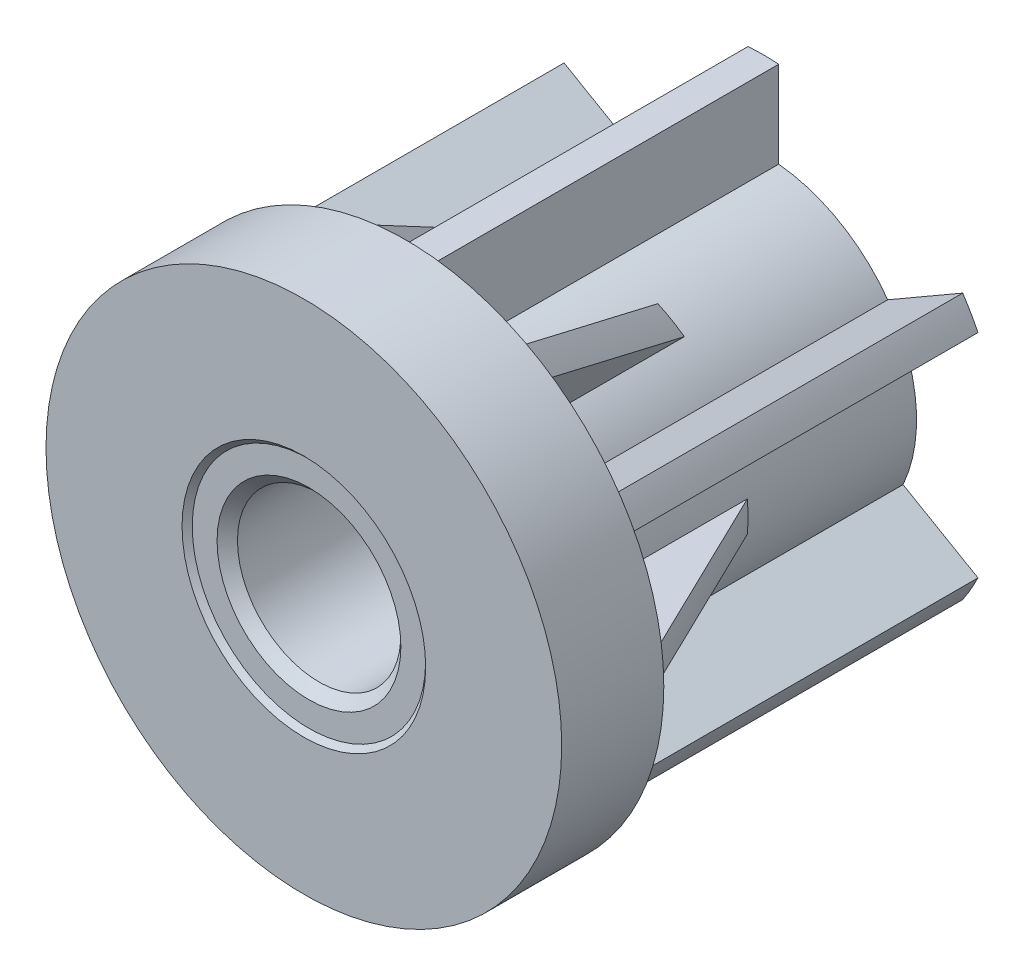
ISO-10303-21;
HEADER;
FILE_DESCRIPTION(('STEP AP214'),'2;1');
FILE_NAME('part.step','',(''),(''),'','','');
FILE_SCHEMA(('AUTOMOTIVE_DESIGN { 1 0 10303 214 1 1 1 1 }'));
ENDSEC;
DATA;
#1=APPLICATION_CONTEXT('core data for automotive mechanical design processes');
#2=APPLICATION_PROTOCOL_DEFINITION('international standard','automotive_design',2000,#1);
#3=PRODUCT_CONTEXT('',#1,'mechanical');
#4=PRODUCT('Part','Part','',(#3));
#5=PRODUCT_RELATED_PRODUCT_CATEGORY('part','',(#4));
#6=PRODUCT_DEFINITION_FORMATION('','',#4);
#7=PRODUCT_DEFINITION_CONTEXT('part definition',#1,'design');
#8=PRODUCT_DEFINITION('design','',#6,#7);
#9=PRODUCT_DEFINITION_SHAPE('','',#8);
#10=(LENGTH_UNIT() NAMED_UNIT(*) SI_UNIT(.MILLI.,.METRE.));
#11=(NAMED_UNIT(*) PLANE_ANGLE_UNIT() SI_UNIT($,.RADIAN.));
#12=(NAMED_UNIT(*) SI_UNIT($,.STERADIAN.) SOLID_ANGLE_UNIT());
#13=UNCERTAINTY_MEASURE_WITH_UNIT(LENGTH_MEASURE(1.E-05),#10,'distance_accuracy_value','');
#14=(GEOMETRIC_REPRESENTATION_CONTEXT(3) GLOBAL_UNCERTAINTY_ASSIGNED_CONTEXT((#13)) GLOBAL_UNIT_ASSIGNED_CONTEXT((#10,
#11,#12)) REPRESENTATION_CONTEXT('',''));
#15=CARTESIAN_POINT('',(0.,0.,0.));
#16=DIRECTION('',(0.,0.,1.));
#17=DIRECTION('',(1.,0.,0.));
#18=AXIS2_PLACEMENT_3D('',#15,#16,#17);
#19=CARTESIAN_POINT('',(0.,0.,-9.));
#20=DIRECTION('',(0.,0.,-1.));
#21=DIRECTION('',(-1.,0.,0.));
#22=AXIS2_PLACEMENT_3D('',#19,#20,#21);
#23=CYLINDRICAL_SURFACE('',#22,9.25);
#24=CARTESIAN_POINT('',(0.,0.,-13.));
#25=DIRECTION('',(0.,0.,-1.));
#26=DIRECTION('',(-1.,0.,0.));
#27=AXIS2_PLACEMENT_3D('',#24,#25,#26);
#28=CIRCLE('',#27,9.25);
#29=CARTESIAN_POINT('',(-9.25,0.,-13.));
#30=VERTEX_POINT('',#29);
#31=EDGE_CURVE('E1471',#30,#30,#28,.T.);
#32=ORIENTED_EDGE('',*,*,#31,.T.);
#33=EDGE_LOOP('',(#32));
#34=FACE_BOUND('',#33,.T.);
#35=CARTESIAN_POINT('',(0.,0.,-5.));
#36=DIRECTION('',(0.,0.,-1.));
#37=DIRECTION('',(-1.,0.,0.));
#38=AXIS2_PLACEMENT_3D('',#35,#36,#37);
#39=CIRCLE('',#38,9.25);
#40=CARTESIAN_POINT('',(-9.25,0.,-5.));
#41=VERTEX_POINT('',#40);
#42=EDGE_CURVE('E1472',#41,#41,#39,.F.);
#43=ORIENTED_EDGE('',*,*,#42,.T.);
#44=EDGE_LOOP('',(#43));
#45=FACE_BOUND('',#44,.T.);
#46=ADVANCED_FACE('F14',(#34,#45),#23,.F.);
#47=CARTESIAN_POINT('',(0.,8.625,-5.));
#48=DIRECTION('',(0.,0.,1.));
#49=DIRECTION('',(1.,0.,0.));
#50=AXIS2_PLACEMENT_3D('',#47,#48,#49);
#51=PLANE('',#50);
#52=ORIENTED_EDGE('',*,*,#42,.F.);
#53=EDGE_LOOP('',(#52));
#54=FACE_BOUND('',#53,.T.);
#55=CARTESIAN_POINT('',(0.,0.,-5.));
#56=DIRECTION('',(0.,0.,-1.));
#57=DIRECTION('',(-1.,0.,0.));
#58=AXIS2_PLACEMENT_3D('',#55,#56,#57);
#59=CIRCLE('',#58,8.);
#60=CARTESIAN_POINT('',(-8.,0.,-5.));
#61=VERTEX_POINT('',#60);
#62=EDGE_CURVE('E694',#61,#61,#59,.F.);
#63=ORIENTED_EDGE('',*,*,#62,.T.);
#64=EDGE_LOOP('',(#63));
#65=FACE_BOUND('',#64,.T.);
#66=ADVANCED_FACE('F1408',(#54,#65),#51,.F.);
#67=CARTESIAN_POINT('',(0.,9.875,-13.));
#68=DIRECTION('',(0.,0.,1.));
#69=DIRECTION('',(1.,0.,0.));
#70=AXIS2_PLACEMENT_3D('',#67,#68,#69);
#71=PLANE('',#70);
#72=CARTESIAN_POINT('',(0.,0.,-13.));
#73=DIRECTION('',(0.,0.,1.));
#74=DIRECTION('',(1.,0.,0.));
#75=AXIS2_PLACEMENT_3D('',#72,#73,#74);
#76=CIRCLE('',#75,10.4019501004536);
#77=CARTESIAN_POINT('',(10.4019501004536,0.,-13.));
#78=VERTEX_POINT('',#77);
#79=EDGE_CURVE('E1468',#78,#78,#76,.T.);
#80=ORIENTED_EDGE('',*,*,#79,.F.);
#81=EDGE_LOOP('',(#80));
#82=FACE_BOUND('',#81,.T.);
#83=ORIENTED_EDGE('',*,*,#31,.F.);
#84=EDGE_LOOP('',(#83));
#85=FACE_BOUND('',#84,.T.);
#86=ADVANCED_FACE('F1417',(#82,#85),#71,.F.);
#87=CARTESIAN_POINT('',(0.,0.,-0.999999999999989));
#88=DIRECTION('',(0.,0.,1.));
#89=DIRECTION('',(1.,0.,0.));
#90=AXIS2_PLACEMENT_3D('',#87,#88,#89);
#91=CONICAL_SURFACE('',#90,23.45,0.449839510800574);
#92=CARTESIAN_POINT('',(-23.4019764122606,-1.5,-1.));
#93=CARTESIAN_POINT('',(-22.6962047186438,-1.5,-2.45865234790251));
#94=CARTESIAN_POINT('',(-21.9903363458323,-1.5,-3.9172579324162));
#95=CARTESIAN_POINT('',(-20.5783155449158,-1.5,-6.83433145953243));
#96=CARTESIAN_POINT('',(-19.872163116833,-1.5,-8.29279940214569));
#97=CARTESIAN_POINT('',(-18.4594833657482,-1.5,-11.2095538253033));
#98=CARTESIAN_POINT('',(-17.7529560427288,-1.5,-12.6678403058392));
#99=CARTESIAN_POINT('',(-16.3393457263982,-1.5,-15.5841440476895));
#100=CARTESIAN_POINT('',(-15.6322627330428,-1.5,-17.0421613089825));
#101=CARTESIAN_POINT('',(-14.9248115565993,-1.5,-18.5));
#102=B_SPLINE_CURVE_WITH_KNOTS('',3,(#92,#93,#94,#95,#96,#97,#98,#99,#100,#101),.UNSPECIFIED.,
.F.,.F.,(4,2,2,2,4),(0.,4.86127795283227,9.72255552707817,14.5838333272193,19.4451115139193),.UNSPECIFIED.);
#103=CARTESIAN_POINT('',(-23.4019764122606,-1.5,-1.));
#104=VERTEX_POINT('',#103);
#105=CARTESIAN_POINT('',(-14.9248115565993,-1.5,-18.5));
#106=VERTEX_POINT('',#105);
#107=EDGE_CURVE('E683',#104,#106,#102,.T.);
#108=ORIENTED_EDGE('',*,*,#107,.F.);
#109=CARTESIAN_POINT('',(5.25707855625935E-13,1.88468985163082E-13,-1.));
#110=DIRECTION('',(0.,0.,1.));
#111=DIRECTION('',(1.,0.,0.));
#112=AXIS2_PLACEMENT_3D('',#109,#110,#111);
#113=CIRCLE('',#112,23.4500000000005);
#114=CARTESIAN_POINT('',(-23.4019764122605,1.5,-1.));
#115=VERTEX_POINT('',#114);
#116=EDGE_CURVE('E323',#115,#104,#113,.T.);
#117=ORIENTED_EDGE('',*,*,#116,.F.);
#118=CARTESIAN_POINT('',(-14.9248115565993,1.5,-18.5));
#119=CARTESIAN_POINT('',(-15.6322627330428,1.5,-17.0421613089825));
#120=CARTESIAN_POINT('',(-16.3393457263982,1.5,-15.5841440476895));
#121=CARTESIAN_POINT('',(-17.7529560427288,1.5,-12.6678403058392));
#122=CARTESIAN_POINT('',(-18.4594833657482,1.5,-11.2095538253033));
#123=CARTESIAN_POINT('',(-19.872163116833,1.5,-8.29279940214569));
#124=CARTESIAN_POINT('',(-20.5783155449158,1.5,-6.83433145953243));
#125=CARTESIAN_POINT('',(-21.9903363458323,1.5,-3.9172579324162));
#126=CARTESIAN_POINT('',(-22.6962047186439,1.5,-2.45865234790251));
#127=CARTESIAN_POINT('',(-23.4019764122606,1.5,-1.));
#128=B_SPLINE_CURVE_WITH_KNOTS('',3,(#118,#119,#120,#121,#122,#123,#124,#125,#126,#127),
.UNSPECIFIED.,.F.,.F.,(4,2,2,2,4),(0.,4.86127818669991,9.72255598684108,14.583833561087,
19.4451115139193),.UNSPECIFIED.);
#129=CARTESIAN_POINT('',(-14.9248115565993,1.5,-18.5));
#130=VERTEX_POINT('',#129);
#131=EDGE_CURVE('E316',#130,#115,#128,.T.);
#132=ORIENTED_EDGE('',*,*,#131,.F.);
#133=CARTESIAN_POINT('',(0.,0.,-18.5));
#134=DIRECTION('',(0.,0.,-1.));
#135=DIRECTION('',(-1.,0.,0.));
#136=AXIS2_PLACEMENT_3D('',#133,#134,#135);
#137=CIRCLE('',#136,15.);
#138=EDGE_CURVE('E320',#106,#130,#137,.T.);
#139=ORIENTED_EDGE('',*,*,#138,.F.);
#140=EDGE_LOOP('',(#108,#117,#132,#139));
#141=FACE_BOUND('',#140,.T.);
#142=ADVANCED_FACE('F318',(#141),#91,.T.);
#143=CARTESIAN_POINT('',(0.,0.,-1.));
#144=DIRECTION('',(0.,0.,1.));
#145=DIRECTION('',(1.,0.,0.));
#146=AXIS2_PLACEMENT_3D('',#143,#144,#145);
#147=CONICAL_SURFACE('',#146,23.45,0.449839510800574);
#148=CARTESIAN_POINT('',(-10.4019501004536,-21.0167060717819,-1.));
#149=CARTESIAN_POINT('',(-10.0490642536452,-20.4054898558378,-2.45865234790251));
#150=CARTESIAN_POINT('',(-9.69613006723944,-19.794189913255,-3.9172579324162));
#151=CARTESIAN_POINT('',(-8.9901196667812,-18.5713440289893,-6.83433145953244));
#152=CARTESIAN_POINT('',(-8.63704345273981,-17.9597980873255,-8.29279940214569));
#153=CARTESIAN_POINT('',(-7.93070357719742,-16.7363815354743,-11.2095538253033));
#154=CARTESIAN_POINT('',(-7.57743991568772,-16.1245109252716,-12.6678403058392));
#155=CARTESIAN_POINT('',(-6.8706347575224,-14.9002884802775,-15.5841440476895));
#156=CARTESIAN_POINT('',(-6.51709326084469,-14.2879366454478,-17.0421613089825));
#157=CARTESIAN_POINT('',(-6.16336767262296,-13.6752659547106,-18.5));
#158=B_SPLINE_CURVE_WITH_KNOTS('',3,(#148,#149,#150,#151,#152,#153,#154,#155,#156,#157),
.UNSPECIFIED.,.F.,.F.,(4,2,2,2,4),(0.,4.86127795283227,9.72255552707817,14.5838333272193,
19.4451115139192),.UNSPECIFIED.);
#159=CARTESIAN_POINT('',(-10.4019501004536,-21.0167060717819,-1.));
#160=VERTEX_POINT('',#159);
#161=CARTESIAN_POINT('',(-6.16336767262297,-13.6752659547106,-18.5));
#162=VERTEX_POINT('',#161);
#163=EDGE_CURVE('E634',#160,#162,#158,.T.);
#164=ORIENTED_EDGE('',*,*,#163,.F.);
#165=CARTESIAN_POINT('',(-6.99978363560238E-13,-1.32520908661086E-12,-1.));
#166=DIRECTION('',(0.,0.,1.));
#167=DIRECTION('',(1.,0.,0.));
#168=AXIS2_PLACEMENT_3D('',#165,#166,#167);
#169=CIRCLE('',#168,23.4499999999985);
#170=CARTESIAN_POINT('',(-13.0000263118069,-19.5167060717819,-1.));
#171=VERTEX_POINT('',#170);
#172=EDGE_CURVE('E650',#171,#160,#169,.T.);
#173=ORIENTED_EDGE('',*,*,#172,.F.);
#174=CARTESIAN_POINT('',(-8.76144388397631,-12.1752659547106,-18.5));
#175=CARTESIAN_POINT('',(-9.11516947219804,-12.7879366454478,-17.0421613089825));
#176=CARTESIAN_POINT('',(-9.46871096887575,-13.4002884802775,-15.5841440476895));
#177=CARTESIAN_POINT('',(-10.1755161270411,-14.6245109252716,-12.6678403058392));
#178=CARTESIAN_POINT('',(-10.5287797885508,-15.2363815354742,-11.2095538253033));
#179=CARTESIAN_POINT('',(-11.2351196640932,-16.4597980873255,-8.29279940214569));
#180=CARTESIAN_POINT('',(-11.5881958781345,-17.0713440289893,-6.83433145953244));
#181=CARTESIAN_POINT('',(-12.2942062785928,-18.294189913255,-3.9172579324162));
#182=CARTESIAN_POINT('',(-12.6471404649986,-18.9054898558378,-2.45865234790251));
#183=CARTESIAN_POINT('',(-13.0000263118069,-19.5167060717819,-1.));
#184=B_SPLINE_CURVE_WITH_KNOTS('',3,(#174,#175,#176,#177,#178,#179,#180,#181,#182,#183),
.UNSPECIFIED.,.F.,.F.,(4,2,2,2,4),(0.,4.86127818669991,9.72255598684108,14.583833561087,
19.4451115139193),.UNSPECIFIED.);
#185=CARTESIAN_POINT('',(-8.7614438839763,-12.1752659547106,-18.5));
#186=VERTEX_POINT('',#185);
#187=EDGE_CURVE('E642',#186,#171,#184,.T.);
#188=ORIENTED_EDGE('',*,*,#187,.F.);
#189=CARTESIAN_POINT('',(0.,0.,-18.5));
#190=DIRECTION('',(0.,0.,-1.));
#191=DIRECTION('',(-1.,0.,0.));
#192=AXIS2_PLACEMENT_3D('',#189,#190,#191);
#193=CIRCLE('',#192,15.);
#194=EDGE_CURVE('E857',#162,#186,#193,.T.);
#195=ORIENTED_EDGE('',*,*,#194,.F.);
#196=EDGE_LOOP('',(#164,#173,#188,#195));
#197=FACE_BOUND('',#196,.T.);
#198=ADVANCED_FACE('F623',(#197),#147,.T.);
#199=CARTESIAN_POINT('',(0.,0.,-1.));
#200=DIRECTION('',(0.,0.,1.));
#201=DIRECTION('',(1.,0.,0.));
#202=AXIS2_PLACEMENT_3D('',#199,#200,#201);
#203=CONICAL_SURFACE('',#202,23.45,0.449839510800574);
#204=CARTESIAN_POINT('',(13.0000263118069,-19.5167060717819,-1.));
#205=CARTESIAN_POINT('',(12.6471404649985,-18.9054898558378,-2.45865234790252));
#206=CARTESIAN_POINT('',(12.2942062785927,-18.294189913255,-3.91725793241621));
#207=CARTESIAN_POINT('',(11.5881958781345,-17.0713440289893,-6.83433145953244));
#208=CARTESIAN_POINT('',(11.2351196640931,-16.4597980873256,-8.2927994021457));
#209=CARTESIAN_POINT('',(10.5287797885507,-15.2363815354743,-11.2095538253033));
#210=CARTESIAN_POINT('',(10.175516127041,-14.6245109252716,-12.6678403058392));
#211=CARTESIAN_POINT('',(9.4687109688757,-13.4002884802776,-15.5841440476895));
#212=CARTESIAN_POINT('',(9.115169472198,-12.7879366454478,-17.0421613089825));
#213=CARTESIAN_POINT('',(8.76144388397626,-12.1752659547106,-18.5));
#214=B_SPLINE_CURVE_WITH_KNOTS('',3,(#204,#205,#206,#207,#208,#209,#210,#211,#212,#213),
.UNSPECIFIED.,.F.,.F.,(4,2,2,2,4),(0.,4.86127795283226,9.72255552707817,14.5838333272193,
19.4451115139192),.UNSPECIFIED.);
#215=CARTESIAN_POINT('',(13.0000263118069,-19.5167060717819,-1.));
#216=VERTEX_POINT('',#215);
#217=CARTESIAN_POINT('',(8.76144388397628,-12.1752659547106,-18.5));
#218=VERTEX_POINT('',#217);
#219=EDGE_CURVE('E604',#216,#218,#214,.T.);
#220=ORIENTED_EDGE('',*,*,#219,.F.);
#221=CARTESIAN_POINT('',(0.,-4.19267098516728E-13,-1.));
#222=DIRECTION('',(0.,0.,1.));
#223=DIRECTION('',(1.,0.,0.));
#224=AXIS2_PLACEMENT_3D('',#221,#222,#223);
#225=CIRCLE('',#224,23.4499999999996);
#226=CARTESIAN_POINT('',(10.4019501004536,-21.0167060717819,-1.));
#227=VERTEX_POINT('',#226);
#228=EDGE_CURVE('E837',#227,#216,#225,.T.);
#229=ORIENTED_EDGE('',*,*,#228,.F.);
#230=CARTESIAN_POINT('',(6.16336767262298,-13.6752659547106,-18.5));
#231=CARTESIAN_POINT('',(6.51709326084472,-14.2879366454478,-17.0421613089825));
#232=CARTESIAN_POINT('',(6.87063475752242,-14.9002884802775,-15.5841440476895));
#233=CARTESIAN_POINT('',(7.57743991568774,-16.1245109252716,-12.6678403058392));
#234=CARTESIAN_POINT('',(7.93070357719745,-16.7363815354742,-11.2095538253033));
#235=CARTESIAN_POINT('',(8.63704345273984,-17.9597980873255,-8.29279940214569));
#236=CARTESIAN_POINT('',(8.99011966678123,-18.5713440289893,-6.83433145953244));
#237=CARTESIAN_POINT('',(9.69613006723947,-19.794189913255,-3.9172579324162));
#238=CARTESIAN_POINT('',(10.0490642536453,-20.4054898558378,-2.45865234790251));
#239=CARTESIAN_POINT('',(10.4019501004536,-21.0167060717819,-1.));
#240=B_SPLINE_CURVE_WITH_KNOTS('',3,(#230,#231,#232,#233,#234,#235,#236,#237,#238,#239),
.UNSPECIFIED.,.F.,.F.,(4,2,2,2,4),(0.,4.86127818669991,9.72255598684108,14.583833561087,
19.4451115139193),.UNSPECIFIED.);
#241=CARTESIAN_POINT('',(6.16336767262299,-13.6752659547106,-18.5));
#242=VERTEX_POINT('',#241);
#243=EDGE_CURVE('E613',#242,#227,#240,.T.);
#244=ORIENTED_EDGE('',*,*,#243,.F.);
#245=CARTESIAN_POINT('',(0.,0.,-18.5));
#246=DIRECTION('',(0.,0.,-1.));
#247=DIRECTION('',(-1.,0.,0.));
#248=AXIS2_PLACEMENT_3D('',#245,#246,#247);
#249=CIRCLE('',#248,15.);
#250=EDGE_CURVE('E831',#218,#242,#249,.T.);
#251=ORIENTED_EDGE('',*,*,#250,.F.);
#252=EDGE_LOOP('',(#220,#229,#244,#251));
#253=FACE_BOUND('',#252,.T.);
#254=ADVANCED_FACE('F619',(#253),#203,.T.);
#255=CARTESIAN_POINT('',(0.,0.,-0.999999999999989));
#256=DIRECTION('',(0.,0.,1.));
#257=DIRECTION('',(1.,0.,0.));
#258=AXIS2_PLACEMENT_3D('',#255,#256,#257);
#259=CONICAL_SURFACE('',#258,23.45,0.449839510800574);
#260=CARTESIAN_POINT('',(14.9248115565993,-1.5,-18.5));
#261=CARTESIAN_POINT('',(15.6322627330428,-1.5,-17.0421613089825));
#262=CARTESIAN_POINT('',(16.3393457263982,-1.5,-15.5841440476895));
#263=CARTESIAN_POINT('',(17.7529560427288,-1.5,-12.6678403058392));
#264=CARTESIAN_POINT('',(18.4594833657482,-1.5,-11.2095538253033));
#265=CARTESIAN_POINT('',(19.872163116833,-1.5,-8.29279940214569));
#266=CARTESIAN_POINT('',(20.5783155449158,-1.5,-6.83433145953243));
#267=CARTESIAN_POINT('',(21.9903363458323,-1.5,-3.9172579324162));
#268=CARTESIAN_POINT('',(22.6962047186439,-1.5,-2.45865234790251));
#269=CARTESIAN_POINT('',(23.4019764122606,-1.5,-1.));
#270=B_SPLINE_CURVE_WITH_KNOTS('',3,(#260,#261,#262,#263,#264,#265,#266,#267,#268,#269),
.UNSPECIFIED.,.F.,.F.,(4,2,2,2,4),(0.,4.86127818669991,9.72255598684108,14.583833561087,
19.4451115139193),.UNSPECIFIED.);
#271=CARTESIAN_POINT('',(14.9248115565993,-1.5,-18.5));
#272=VERTEX_POINT('',#271);
#273=CARTESIAN_POINT('',(23.4019764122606,-1.5,-1.));
#274=VERTEX_POINT('',#273);
#275=EDGE_CURVE('E564',#272,#274,#270,.T.);
#276=ORIENTED_EDGE('',*,*,#275,.F.);
#277=CARTESIAN_POINT('',(0.,0.,-18.5));
#278=DIRECTION('',(0.,0.,-1.));
#279=DIRECTION('',(-1.,0.,0.));
#280=AXIS2_PLACEMENT_3D('',#277,#278,#279);
#281=CIRCLE('',#280,15.);
#282=CARTESIAN_POINT('',(14.9248115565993,1.5,-18.5));
#283=VERTEX_POINT('',#282);
#284=EDGE_CURVE('E807',#283,#272,#281,.T.);
#285=ORIENTED_EDGE('',*,*,#284,.F.);
#286=CARTESIAN_POINT('',(23.4019764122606,1.5,-1.));
#287=CARTESIAN_POINT('',(22.6962047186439,1.5,-2.45865234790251));
#288=CARTESIAN_POINT('',(21.9903363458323,1.5,-3.9172579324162));
#289=CARTESIAN_POINT('',(20.5783155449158,1.5,-6.83433145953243));
#290=CARTESIAN_POINT('',(19.872163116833,1.5,-8.29279940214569));
#291=CARTESIAN_POINT('',(18.4594833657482,1.5,-11.2095538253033));
#292=CARTESIAN_POINT('',(17.7529560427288,1.5,-12.6678403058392));
#293=CARTESIAN_POINT('',(16.3393457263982,1.5,-15.5841440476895));
#294=CARTESIAN_POINT('',(15.6322627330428,1.5,-17.0421613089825));
#295=CARTESIAN_POINT('',(14.9248115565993,1.5,-18.5));
#296=B_SPLINE_CURVE_WITH_KNOTS('',3,(#286,#287,#288,#289,#290,#291,#292,#293,#294,#295),
.UNSPECIFIED.,.F.,.F.,(4,2,2,2,4),(0.,4.86127795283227,9.72255552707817,14.5838333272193,
19.4451115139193),.UNSPECIFIED.);
#297=CARTESIAN_POINT('',(23.4019764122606,1.5,-1.));
#298=VERTEX_POINT('',#297);
#299=EDGE_CURVE('E555',#298,#283,#296,.T.);
#300=ORIENTED_EDGE('',*,*,#299,.F.);
#301=CARTESIAN_POINT('',(-4.97473683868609E-13,-1.99220895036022E-13,-1.));
#302=DIRECTION('',(0.,0.,1.));
#303=DIRECTION('',(1.,0.,0.));
#304=AXIS2_PLACEMENT_3D('',#301,#302,#303);
#305=CIRCLE('',#304,23.4500000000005);
#306=EDGE_CURVE('E571',#274,#298,#305,.T.);
#307=ORIENTED_EDGE('',*,*,#306,.F.);
#308=EDGE_LOOP('',(#276,#285,#300,#307));
#309=FACE_BOUND('',#308,.T.);
#310=ADVANCED_FACE('F498',(#309),#259,.T.);
#311=CARTESIAN_POINT('',(0.,0.,-1.));
#312=DIRECTION('',(0.,0.,1.));
#313=DIRECTION('',(1.,0.,0.));
#314=AXIS2_PLACEMENT_3D('',#311,#312,#313);
#315=CONICAL_SURFACE('',#314,23.45,0.449839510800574);
#316=CARTESIAN_POINT('',(10.4019501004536,21.0167060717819,-1.));
#317=CARTESIAN_POINT('',(10.0490642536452,20.4054898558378,-2.45865234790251));
#318=CARTESIAN_POINT('',(9.69613006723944,19.794189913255,-3.91725793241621));
#319=CARTESIAN_POINT('',(8.9901196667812,18.5713440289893,-6.83433145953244));
#320=CARTESIAN_POINT('',(8.63704345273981,17.9597980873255,-8.2927994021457));
#321=CARTESIAN_POINT('',(7.93070357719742,16.7363815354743,-11.2095538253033));
#322=CARTESIAN_POINT('',(7.57743991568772,16.1245109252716,-12.6678403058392));
#323=CARTESIAN_POINT('',(6.87063475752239,14.9002884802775,-15.5841440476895));
#324=CARTESIAN_POINT('',(6.51709326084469,14.2879366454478,-17.0421613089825));
#325=CARTESIAN_POINT('',(6.16336767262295,13.6752659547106,-18.5));
#326=B_SPLINE_CURVE_WITH_KNOTS('',3,(#316,#317,#318,#319,#320,#321,#322,#323,#324,#325),
.UNSPECIFIED.,.F.,.F.,(4,2,2,2,4),(0.,4.86127795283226,9.72255552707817,14.5838333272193,
19.4451115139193),.UNSPECIFIED.);
#327=CARTESIAN_POINT('',(10.4019501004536,21.0167060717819,-1.));
#328=VERTEX_POINT('',#327);
#329=CARTESIAN_POINT('',(6.16336767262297,13.6752659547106,-18.5));
#330=VERTEX_POINT('',#329);
#331=EDGE_CURVE('E504',#328,#330,#326,.T.);
#332=ORIENTED_EDGE('',*,*,#331,.F.);
#333=CARTESIAN_POINT('',(3.64059383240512E-13,5.32860167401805E-13,-1.));
#334=DIRECTION('',(0.,0.,1.));
#335=DIRECTION('',(1.,0.,0.));
#336=AXIS2_PLACEMENT_3D('',#333,#334,#335);
#337=CIRCLE('',#336,23.4499999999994);
#338=CARTESIAN_POINT('',(13.0000263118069,19.5167060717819,-1.));
#339=VERTEX_POINT('',#338);
#340=EDGE_CURVE('E520',#339,#328,#337,.T.);
#341=ORIENTED_EDGE('',*,*,#340,.F.);
#342=CARTESIAN_POINT('',(8.76144388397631,12.1752659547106,-18.5));
#343=CARTESIAN_POINT('',(9.11516947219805,12.7879366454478,-17.0421613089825));
#344=CARTESIAN_POINT('',(9.46871096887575,13.4002884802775,-15.5841440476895));
#345=CARTESIAN_POINT('',(10.1755161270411,14.6245109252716,-12.6678403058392));
#346=CARTESIAN_POINT('',(10.5287797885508,15.2363815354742,-11.2095538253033));
#347=CARTESIAN_POINT('',(11.2351196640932,16.4597980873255,-8.29279940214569));
#348=CARTESIAN_POINT('',(11.5881958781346,17.0713440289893,-6.83433145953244));
#349=CARTESIAN_POINT('',(12.2942062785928,18.294189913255,-3.9172579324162));
#350=CARTESIAN_POINT('',(12.6471404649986,18.9054898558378,-2.45865234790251));
#351=CARTESIAN_POINT('',(13.0000263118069,19.5167060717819,-1.));
#352=B_SPLINE_CURVE_WITH_KNOTS('',3,(#342,#343,#344,#345,#346,#347,#348,#349,#350,#351),
.UNSPECIFIED.,.F.,.F.,(4,2,2,2,4),(0.,4.86127818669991,9.72255598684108,14.583833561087,
19.4451115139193),.UNSPECIFIED.);
#353=CARTESIAN_POINT('',(8.7614438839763,12.1752659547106,-18.5));
#354=VERTEX_POINT('',#353);
#355=EDGE_CURVE('E512',#354,#339,#352,.T.);
#356=ORIENTED_EDGE('',*,*,#355,.F.);
#357=CARTESIAN_POINT('',(0.,0.,-18.5));
#358=DIRECTION('',(0.,0.,-1.));
#359=DIRECTION('',(-1.,0.,0.));
#360=AXIS2_PLACEMENT_3D('',#357,#358,#359);
#361=CIRCLE('',#360,15.);
#362=EDGE_CURVE('E782',#330,#354,#361,.T.);
#363=ORIENTED_EDGE('',*,*,#362,.F.);
#364=EDGE_LOOP('',(#332,#341,#356,#363));
#365=FACE_BOUND('',#364,.T.);
#366=ADVANCED_FACE('F491',(#365),#315,.T.);
#367=CARTESIAN_POINT('',(0.,0.,-1.));
#368=DIRECTION('',(0.,0.,1.));
#369=DIRECTION('',(1.,0.,0.));
#370=AXIS2_PLACEMENT_3D('',#367,#368,#369);
#371=CONICAL_SURFACE('',#370,23.45,0.449839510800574);
#372=CARTESIAN_POINT('',(-13.0000263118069,19.5167060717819,-1.));
#373=CARTESIAN_POINT('',(-12.6471404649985,18.9054898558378,-2.45865234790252));
#374=CARTESIAN_POINT('',(-12.2942062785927,18.294189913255,-3.91725793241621));
#375=CARTESIAN_POINT('',(-11.5881958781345,17.0713440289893,-6.83433145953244));
#376=CARTESIAN_POINT('',(-11.2351196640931,16.4597980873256,-8.2927994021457));
#377=CARTESIAN_POINT('',(-10.5287797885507,15.2363815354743,-11.2095538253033));
#378=CARTESIAN_POINT('',(-10.175516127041,14.6245109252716,-12.6678403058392));
#379=CARTESIAN_POINT('',(-9.46871096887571,13.4002884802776,-15.5841440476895));
#380=CARTESIAN_POINT('',(-9.115169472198,12.7879366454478,-17.0421613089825));
#381=CARTESIAN_POINT('',(-8.76144388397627,12.1752659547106,-18.5));
#382=B_SPLINE_CURVE_WITH_KNOTS('',3,(#372,#373,#374,#375,#376,#377,#378,#379,#380,#381),
.UNSPECIFIED.,.F.,.F.,(4,2,2,2,4),(0.,4.86127795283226,9.72255552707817,14.5838333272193,
19.4451115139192),.UNSPECIFIED.);
#383=CARTESIAN_POINT('',(-13.0000263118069,19.5167060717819,-1.));
#384=VERTEX_POINT('',#383);
#385=CARTESIAN_POINT('',(-8.76144388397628,12.1752659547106,-18.5));
#386=VERTEX_POINT('',#385);
#387=EDGE_CURVE('E464',#384,#386,#382,.T.);
#388=ORIENTED_EDGE('',*,*,#387,.F.);
#389=CARTESIAN_POINT('',(3.10768678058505E-13,-6.14666350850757E-13,-1.));
#390=DIRECTION('',(0.,0.,1.));
#391=DIRECTION('',(1.,0.,0.));
#392=AXIS2_PLACEMENT_3D('',#389,#390,#391);
#393=CIRCLE('',#392,23.4500000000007);
#394=CARTESIAN_POINT('',(-10.4019501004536,21.0167060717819,-1.));
#395=VERTEX_POINT('',#394);
#396=EDGE_CURVE('E890',#395,#384,#393,.T.);
#397=ORIENTED_EDGE('',*,*,#396,.F.);
#398=CARTESIAN_POINT('',(-6.163367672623,13.6752659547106,-18.5));
#399=CARTESIAN_POINT('',(-6.51709326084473,14.2879366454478,-17.0421613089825));
#400=CARTESIAN_POINT('',(-6.87063475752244,14.9002884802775,-15.5841440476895));
#401=CARTESIAN_POINT('',(-7.57743991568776,16.1245109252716,-12.6678403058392));
#402=CARTESIAN_POINT('',(-7.93070357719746,16.7363815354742,-11.2095538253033));
#403=CARTESIAN_POINT('',(-8.63704345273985,17.9597980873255,-8.29279940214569));
#404=CARTESIAN_POINT('',(-8.99011966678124,18.5713440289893,-6.83433145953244));
#405=CARTESIAN_POINT('',(-9.69613006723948,19.794189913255,-3.9172579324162));
#406=CARTESIAN_POINT('',(-10.0490642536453,20.4054898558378,-2.45865234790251));
#407=CARTESIAN_POINT('',(-10.4019501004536,21.0167060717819,-1.));
#408=B_SPLINE_CURVE_WITH_KNOTS('',3,(#398,#399,#400,#401,#402,#403,#404,#405,#406,#407),
.UNSPECIFIED.,.F.,.F.,(4,2,2,2,4),(0.,4.86127818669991,9.72255598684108,14.583833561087,
19.4451115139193),.UNSPECIFIED.);
#409=CARTESIAN_POINT('',(-6.16336767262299,13.6752659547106,-18.5));
#410=VERTEX_POINT('',#409);
#411=EDGE_CURVE('E474',#410,#395,#408,.T.);
#412=ORIENTED_EDGE('',*,*,#411,.F.);
#413=CARTESIAN_POINT('',(0.,0.,-18.5));
#414=DIRECTION('',(0.,0.,-1.));
#415=DIRECTION('',(-1.,0.,0.));
#416=AXIS2_PLACEMENT_3D('',#413,#414,#415);
#417=CIRCLE('',#416,15.);
#418=EDGE_CURVE('E762',#386,#410,#417,.T.);
#419=ORIENTED_EDGE('',*,*,#418,.F.);
#420=EDGE_LOOP('',(#388,#397,#412,#419));
#421=FACE_BOUND('',#420,.T.);
#422=ADVANCED_FACE('F485',(#421),#371,.T.);
#423=CARTESIAN_POINT('',(0.,7.5,-35.));
#424=DIRECTION('',(0.,0.,-1.));
#425=DIRECTION('',(-1.,0.,0.));
#426=AXIS2_PLACEMENT_3D('',#423,#424,#425);
#427=PLANE('',#426);
#428=CARTESIAN_POINT('',(-6.32112230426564E-13,4.63764537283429E-13,-35.));
#429=DIRECTION('',(0.,0.,1.));
#430=DIRECTION('',(1.,0.,0.));
#431=AXIS2_PLACEMENT_3D('',#428,#429,#430);
#432=CIRCLE('',#431,23.4499999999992);
#433=CARTESIAN_POINT('',(-19.5167060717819,13.0000263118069,-35.));
#434=VERTEX_POINT('',#433);
#435=CARTESIAN_POINT('',(-21.0167060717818,10.4019501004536,-35.));
#436=VERTEX_POINT('',#435);
#437=EDGE_CURVE('E456',#434,#436,#432,.T.);
#438=ORIENTED_EDGE('',*,*,#437,.F.);
#439=DIRECTION('',(0.866025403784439,-0.5,0.));
#440=VECTOR('',#439,1.);
#441=CARTESIAN_POINT('',(-6.9352130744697,5.73609794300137,-35.));
#442=LINE('',#441,#440);
#443=CARTESIAN_POINT('',(-12.1752659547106,8.76144388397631,-35.));
#444=VERTEX_POINT('',#443);
#445=EDGE_CURVE('E884',#444,#434,#442,.F.);
#446=ORIENTED_EDGE('',*,*,#445,.F.);
#447=CARTESIAN_POINT('',(0.,0.,-35.));
#448=DIRECTION('',(0.,0.,-1.));
#449=DIRECTION('',(-1.,0.,0.));
#450=AXIS2_PLACEMENT_3D('',#447,#448,#449);
#451=CIRCLE('',#450,15.);
#452=CARTESIAN_POINT('',(-1.5,14.9248115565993,-35.));
#453=VERTEX_POINT('',#452);
#454=EDGE_CURVE('E460',#453,#444,#451,.F.);
#455=ORIENTED_EDGE('',*,*,#454,.F.);
#456=DIRECTION('',(0.,1.,0.));
#457=VECTOR('',#456,1.);
#458=CARTESIAN_POINT('',(-1.5,23.4019764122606,-35.));
#459=LINE('',#458,#457);
#460=CARTESIAN_POINT('',(-1.5,23.4019764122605,-35.));
#461=VERTEX_POINT('',#460);
#462=EDGE_CURVE('E769',#461,#453,#459,.F.);
#463=ORIENTED_EDGE('',*,*,#462,.F.);
#464=CARTESIAN_POINT('',(0.,-5.30995292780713E-13,-35.));
#465=DIRECTION('',(0.,0.,1.));
#466=DIRECTION('',(1.,0.,0.));
#467=AXIS2_PLACEMENT_3D('',#464,#465,#466);
#468=CIRCLE('',#467,23.4500000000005);
#469=CARTESIAN_POINT('',(1.5,23.4019764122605,-35.));
#470=VERTEX_POINT('',#469);
#471=EDGE_CURVE('E770',#470,#461,#468,.T.);
#472=ORIENTED_EDGE('',*,*,#471,.F.);
#473=DIRECTION('',(0.,-1.,0.));
#474=VECTOR('',#473,1.);
#475=CARTESIAN_POINT('',(1.5,8.87411967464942,-35.));
#476=LINE('',#475,#474);
#477=CARTESIAN_POINT('',(1.5,14.9248115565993,-35.));
#478=VERTEX_POINT('',#477);
#479=EDGE_CURVE('E774',#478,#470,#476,.F.);
#480=ORIENTED_EDGE('',*,*,#479,.F.);
#481=CARTESIAN_POINT('',(0.,0.,-35.));
#482=DIRECTION('',(0.,0.,-1.));
#483=DIRECTION('',(-1.,0.,0.));
#484=AXIS2_PLACEMENT_3D('',#481,#482,#483);
#485=CIRCLE('',#484,15.);
#486=CARTESIAN_POINT('',(12.1752659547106,8.76144388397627,-35.));
#487=VERTEX_POINT('',#486);
#488=EDGE_CURVE('E778',#487,#478,#485,.F.);
#489=ORIENTED_EDGE('',*,*,#488,.F.);
#490=DIRECTION('',(0.866025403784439,0.5,0.));
#491=VECTOR('',#490,1.);
#492=CARTESIAN_POINT('',(19.5167060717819,13.0000263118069,-35.));
#493=LINE('',#492,#491);
#494=CARTESIAN_POINT('',(19.5167060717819,13.0000263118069,-35.));
#495=VERTEX_POINT('',#494);
#496=EDGE_CURVE('E521',#495,#487,#493,.F.);
#497=ORIENTED_EDGE('',*,*,#496,.F.);
#498=CARTESIAN_POINT('',(3.69753026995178E-13,1.04940455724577E-13,-35.));
#499=DIRECTION('',(0.,0.,1.));
#500=DIRECTION('',(1.,0.,0.));
#501=AXIS2_PLACEMENT_3D('',#498,#499,#500);
#502=CIRCLE('',#501,23.4499999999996);
#503=CARTESIAN_POINT('',(21.0167060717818,10.4019501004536,-35.));
#504=VERTEX_POINT('',#503);
#505=EDGE_CURVE('E522',#504,#495,#502,.T.);
#506=ORIENTED_EDGE('',*,*,#505,.F.);
#507=DIRECTION('',(-0.866025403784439,-0.5,0.));
#508=VECTOR('',#507,1.);
#509=CARTESIAN_POINT('',(8.4352130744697,3.13802173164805,-35.));
#510=LINE('',#509,#508);
#511=CARTESIAN_POINT('',(13.6752659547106,6.16336767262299,-35.));
#512=VERTEX_POINT('',#511);
#513=EDGE_CURVE('E800',#512,#504,#510,.F.);
#514=ORIENTED_EDGE('',*,*,#513,.F.);
#515=CARTESIAN_POINT('',(0.,0.,-35.));
#516=DIRECTION('',(0.,0.,-1.));
#517=DIRECTION('',(-1.,0.,0.));
#518=AXIS2_PLACEMENT_3D('',#515,#516,#517);
#519=CIRCLE('',#518,15.);
#520=CARTESIAN_POINT('',(13.6752659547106,-6.16336767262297,-35.));
#521=VERTEX_POINT('',#520);
#522=EDGE_CURVE('E563',#521,#512,#519,.F.);
#523=ORIENTED_EDGE('',*,*,#522,.F.);
#524=DIRECTION('',(0.866025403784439,-0.5,0.));
#525=VECTOR('',#524,1.);
#526=CARTESIAN_POINT('',(21.0167060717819,-10.4019501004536,-35.));
#527=LINE('',#526,#525);
#528=CARTESIAN_POINT('',(21.0167060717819,-10.4019501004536,-35.));
#529=VERTEX_POINT('',#528);
#530=EDGE_CURVE('E572',#529,#521,#527,.F.);
#531=ORIENTED_EDGE('',*,*,#530,.F.);
#532=CARTESIAN_POINT('',(1.09805933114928E-12,-6.87314694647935E-13,-35.));
#533=DIRECTION('',(0.,0.,1.));
#534=DIRECTION('',(1.,0.,0.));
#535=AXIS2_PLACEMENT_3D('',#532,#533,#534);
#536=CIRCLE('',#535,23.4499999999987);
#537=CARTESIAN_POINT('',(19.5167060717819,-13.0000263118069,-35.));
#538=VERTEX_POINT('',#537);
#539=EDGE_CURVE('E573',#538,#529,#536,.T.);
#540=ORIENTED_EDGE('',*,*,#539,.F.);
#541=DIRECTION('',(-0.866025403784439,0.5,0.));
#542=VECTOR('',#541,1.);
#543=CARTESIAN_POINT('',(6.93521307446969,-5.73609794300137,-35.));
#544=LINE('',#543,#542);
#545=CARTESIAN_POINT('',(12.1752659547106,-8.76144388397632,-35.));
#546=VERTEX_POINT('',#545);
#547=EDGE_CURVE('E823',#546,#538,#544,.F.);
#548=ORIENTED_EDGE('',*,*,#547,.F.);
#549=CARTESIAN_POINT('',(0.,0.,-35.));
#550=DIRECTION('',(0.,0.,-1.));
#551=DIRECTION('',(-1.,0.,0.));
#552=AXIS2_PLACEMENT_3D('',#549,#550,#551);
#553=CIRCLE('',#552,15.);
#554=CARTESIAN_POINT('',(1.5,-14.9248115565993,-35.));
#555=VERTEX_POINT('',#554);
#556=EDGE_CURVE('E612',#555,#546,#553,.F.);
#557=ORIENTED_EDGE('',*,*,#556,.F.);
#558=DIRECTION('',(0.,-1.,0.));
#559=VECTOR('',#558,1.);
#560=CARTESIAN_POINT('',(1.49999999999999,-23.4019764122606,-35.));
#561=LINE('',#560,#559);
#562=CARTESIAN_POINT('',(1.49999999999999,-23.4019764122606,-35.));
#563=VERTEX_POINT('',#562);
#564=EDGE_CURVE('E844',#563,#555,#561,.F.);
#565=ORIENTED_EDGE('',*,*,#564,.F.);
#566=CARTESIAN_POINT('',(0.,4.99291674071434E-13,-35.));
#567=DIRECTION('',(0.,0.,1.));
#568=DIRECTION('',(1.,0.,0.));
#569=AXIS2_PLACEMENT_3D('',#566,#567,#568);
#570=CIRCLE('',#569,23.4500000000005);
#571=CARTESIAN_POINT('',(-1.5,-23.4019764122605,-35.));
#572=VERTEX_POINT('',#571);
#573=EDGE_CURVE('E845',#572,#563,#570,.T.);
#574=ORIENTED_EDGE('',*,*,#573,.F.);
#575=DIRECTION('',(0.,1.,0.));
#576=VECTOR('',#575,1.);
#577=CARTESIAN_POINT('',(-1.5,-8.87411967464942,-35.));
#578=LINE('',#577,#576);
#579=CARTESIAN_POINT('',(-1.5,-14.9248115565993,-35.));
#580=VERTEX_POINT('',#579);
#581=EDGE_CURVE('E849',#580,#572,#578,.F.);
#582=ORIENTED_EDGE('',*,*,#581,.F.);
#583=CARTESIAN_POINT('',(0.,0.,-35.));
#584=DIRECTION('',(0.,0.,-1.));
#585=DIRECTION('',(-1.,0.,0.));
#586=AXIS2_PLACEMENT_3D('',#583,#584,#585);
#587=CIRCLE('',#586,15.);
#588=CARTESIAN_POINT('',(-12.1752659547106,-8.76144388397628,-35.));
#589=VERTEX_POINT('',#588);
#590=EDGE_CURVE('E858',#589,#580,#587,.F.);
#591=ORIENTED_EDGE('',*,*,#590,.F.);
#592=DIRECTION('',(-0.866025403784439,-0.5,0.));
#593=VECTOR('',#592,1.);
#594=CARTESIAN_POINT('',(-19.5167060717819,-13.0000263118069,-35.));
#595=LINE('',#594,#593);
#596=CARTESIAN_POINT('',(-19.5167060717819,-13.0000263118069,-35.));
#597=VERTEX_POINT('',#596);
#598=EDGE_CURVE('E651',#597,#589,#595,.F.);
#599=ORIENTED_EDGE('',*,*,#598,.F.);
#600=CARTESIAN_POINT('',(3.41331317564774E-13,2.54154430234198E-13,-35.));
#601=DIRECTION('',(0.,0.,1.));
#602=DIRECTION('',(1.,0.,0.));
#603=AXIS2_PLACEMENT_3D('',#600,#601,#602);
#604=CIRCLE('',#603,23.4500000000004);
#605=CARTESIAN_POINT('',(-21.0167060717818,-10.4019501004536,-35.));
#606=VERTEX_POINT('',#605);
#607=EDGE_CURVE('E652',#606,#597,#604,.T.);
#608=ORIENTED_EDGE('',*,*,#607,.F.);
#609=DIRECTION('',(0.866025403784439,0.5,0.));
#610=VECTOR('',#609,1.);
#611=CARTESIAN_POINT('',(-8.4352130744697,-3.13802173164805,-35.));
#612=LINE('',#611,#610);
#613=CARTESIAN_POINT('',(-13.6752659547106,-6.16336767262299,-35.));
#614=VERTEX_POINT('',#613);
#615=EDGE_CURVE('E346',#614,#606,#612,.F.);
#616=ORIENTED_EDGE('',*,*,#615,.F.);
#617=CARTESIAN_POINT('',(0.,0.,-35.));
#618=DIRECTION('',(0.,0.,-1.));
#619=DIRECTION('',(-1.,0.,0.));
#620=AXIS2_PLACEMENT_3D('',#617,#618,#619);
#621=CIRCLE('',#620,15.);
#622=CARTESIAN_POINT('',(-13.6752659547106,6.16336767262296,-35.));
#623=VERTEX_POINT('',#622);
#624=EDGE_CURVE('E342',#623,#614,#621,.F.);
#625=ORIENTED_EDGE('',*,*,#624,.F.);
#626=DIRECTION('',(-0.866025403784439,0.5,0.));
#627=VECTOR('',#626,1.);
#628=CARTESIAN_POINT('',(-21.0167060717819,10.4019501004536,-35.));
#629=LINE('',#628,#627);
#630=EDGE_CURVE('E326',#436,#623,#629,.F.);
#631=ORIENTED_EDGE('',*,*,#630,.F.);
#632=EDGE_LOOP('',(#438,#446,#455,#463,#472,#480,#489,#497,#506,#514,#523,#531,#540,#548,#557,
#565,#574,#582,#591,#599,#608,#616,#625,#631));
#633=FACE_BOUND('',#632,.T.);
#634=CARTESIAN_POINT('',(0.,0.,-35.));
#635=DIRECTION('',(0.,0.,1.));
#636=DIRECTION('',(1.,0.,0.));
#637=AXIS2_PLACEMENT_3D('',#634,#635,#636);
#638=CIRCLE('',#637,10.4019501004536);
#639=CARTESIAN_POINT('',(10.4019501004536,0.,-35.));
#640=VERTEX_POINT('',#639);
#641=EDGE_CURVE('E1484',#640,#640,#638,.T.);
#642=ORIENTED_EDGE('',*,*,#641,.T.);
#643=EDGE_LOOP('',(#642));
#644=FACE_BOUND('',#643,.T.);
#645=ADVANCED_FACE('F490',(#633,#644),#427,.T.);
#646=CARTESIAN_POINT('',(-21.0167060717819,10.4019501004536,10.));
#647=DIRECTION('',(-0.5,-0.866025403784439,0.));
#648=DIRECTION('',(-0.866025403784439,0.5,0.));
#649=AXIS2_PLACEMENT_3D('',#646,#647,#648);
#650=PLANE('',#649);
#651=ORIENTED_EDGE('',*,*,#630,.T.);
#652=DIRECTION('',(0.,0.,-1.));
#653=VECTOR('',#652,1.);
#654=CARTESIAN_POINT('',(-13.6752659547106,6.16336767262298,-17.5));
#655=LINE('',#654,#653);
#656=CARTESIAN_POINT('',(-13.6752659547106,6.16336767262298,0.));
#657=VERTEX_POINT('',#656);
#658=EDGE_CURVE('E879',#657,#623,#655,.T.);
#659=ORIENTED_EDGE('',*,*,#658,.F.);
#660=DIRECTION('',(0.86602540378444,-0.5,0.));
#661=VECTOR('',#660,1.);
#662=CARTESIAN_POINT('',(-21.0167060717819,10.4019501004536,0.));
#663=LINE('',#662,#661);
#664=CARTESIAN_POINT('',(-21.0167060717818,10.4019501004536,0.));
#665=VERTEX_POINT('',#664);
#666=EDGE_CURVE('E455',#665,#657,#663,.T.);
#667=ORIENTED_EDGE('',*,*,#666,.F.);
#668=DIRECTION('',(0.,0.,1.));
#669=VECTOR('',#668,1.);
#670=CARTESIAN_POINT('',(-21.0167060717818,10.4019501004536,10.));
#671=LINE('',#670,#669);
#672=EDGE_CURVE('E459',#436,#665,#671,.T.);
#673=ORIENTED_EDGE('',*,*,#672,.F.);
#674=EDGE_LOOP('',(#651,#659,#667,#673));
#675=FACE_BOUND('',#674,.T.);
#676=ADVANCED_FACE('F698',(#675),#650,.T.);
#677=CARTESIAN_POINT('',(-8.87411967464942,1.5,10.));
#678=DIRECTION('',(0.,1.,0.));
#679=DIRECTION('',(1.,0.,0.));
#680=AXIS2_PLACEMENT_3D('',#677,#678,#679);
#681=PLANE('',#680);
#682=DIRECTION('',(-1.,0.,0.));
#683=VECTOR('',#682,1.);
#684=CARTESIAN_POINT('',(0.,1.5,0.));
#685=LINE('',#684,#683);
#686=CARTESIAN_POINT('',(-14.9248115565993,1.5,0.));
#687=VERTEX_POINT('',#686);
#688=CARTESIAN_POINT('',(-23.4019764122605,1.5,0.));
#689=VERTEX_POINT('',#688);
#690=EDGE_CURVE('E332',#687,#689,#685,.T.);
#691=ORIENTED_EDGE('',*,*,#690,.F.);
#692=DIRECTION('',(0.,0.,-1.));
#693=VECTOR('',#692,1.);
#694=CARTESIAN_POINT('',(-14.9248115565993,1.5,-17.5));
#695=LINE('',#694,#693);
#696=EDGE_CURVE('E329',#130,#687,#695,.F.);
#697=ORIENTED_EDGE('',*,*,#696,.F.);
#698=ORIENTED_EDGE('',*,*,#131,.T.);
#699=DIRECTION('',(0.,0.,1.));
#700=VECTOR('',#699,1.);
#701=CARTESIAN_POINT('',(-23.4019764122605,1.5,10.));
#702=LINE('',#701,#700);
#703=EDGE_CURVE('E349',#689,#115,#702,.F.);
#704=ORIENTED_EDGE('',*,*,#703,.F.);
#705=EDGE_LOOP('',(#691,#697,#698,#704));
#706=FACE_BOUND('',#705,.T.);
#707=ADVANCED_FACE('F330',(#706),#681,.T.);
#708=CARTESIAN_POINT('',(5.26739312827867E-13,1.88984713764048E-13,10.));
#709=DIRECTION('',(0.,0.,1.));
#710=DIRECTION('',(1.,0.,0.));
#711=AXIS2_PLACEMENT_3D('',#708,#709,#710);
#712=CYLINDRICAL_SURFACE('',#711,23.4500000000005);
#713=CARTESIAN_POINT('',(5.25801624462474E-13,1.88515869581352E-13,0.));
#714=DIRECTION('',(0.,0.,1.));
#715=DIRECTION('',(1.,0.,0.));
#716=AXIS2_PLACEMENT_3D('',#713,#714,#715);
#717=CIRCLE('',#716,23.4500000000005);
#718=CARTESIAN_POINT('',(-23.4019764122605,-1.5,0.));
#719=VERTEX_POINT('',#718);
#720=EDGE_CURVE('E450',#689,#719,#717,.T.);
#721=ORIENTED_EDGE('',*,*,#720,.F.);
#722=ORIENTED_EDGE('',*,*,#703,.T.);
#723=ORIENTED_EDGE('',*,*,#116,.T.);
#724=DIRECTION('',(0.,0.,-1.));
#725=VECTOR('',#724,1.);
#726=CARTESIAN_POINT('',(-23.4019764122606,-1.5,10.));
#727=LINE('',#726,#725);
#728=EDGE_CURVE('E688',#719,#104,#727,.T.);
#729=ORIENTED_EDGE('',*,*,#728,.F.);
#730=EDGE_LOOP('',(#721,#722,#723,#729));
#731=FACE_BOUND('',#730,.T.);
#732=ADVANCED_FACE('F679',(#731),#712,.T.);
#733=CARTESIAN_POINT('',(-23.4019764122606,-1.5,10.));
#734=DIRECTION('',(0.,-1.,0.));
#735=DIRECTION('',(-1.,0.,0.));
#736=AXIS2_PLACEMENT_3D('',#733,#734,#735);
#737=PLANE('',#736);
#738=DIRECTION('',(-1.,0.,0.));
#739=VECTOR('',#738,1.);
#740=CARTESIAN_POINT('',(0.,-1.5,0.));
#741=LINE('',#740,#739);
#742=CARTESIAN_POINT('',(-14.9248115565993,-1.5,0.));
#743=VERTEX_POINT('',#742);
#744=EDGE_CURVE('E449',#719,#743,#741,.F.);
#745=ORIENTED_EDGE('',*,*,#744,.F.);
#746=ORIENTED_EDGE('',*,*,#728,.T.);
#747=ORIENTED_EDGE('',*,*,#107,.T.);
#748=DIRECTION('',(0.,0.,-1.));
#749=VECTOR('',#748,1.);
#750=CARTESIAN_POINT('',(-14.9248115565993,-1.5,-17.5));
#751=LINE('',#750,#749);
#752=EDGE_CURVE('E340',#743,#106,#751,.T.);
#753=ORIENTED_EDGE('',*,*,#752,.F.);
#754=EDGE_LOOP('',(#745,#746,#747,#753));
#755=FACE_BOUND('',#754,.T.);
#756=ADVANCED_FACE('F675',(#755),#737,.T.);
#757=CARTESIAN_POINT('',(0.,0.,-17.5));
#758=DIRECTION('',(0.,0.,-1.));
#759=DIRECTION('',(-1.,0.,0.));
#760=AXIS2_PLACEMENT_3D('',#757,#758,#759);
#761=CYLINDRICAL_SURFACE('',#760,15.);
#762=ORIENTED_EDGE('',*,*,#696,.T.);
#763=CARTESIAN_POINT('',(0.,0.,0.));
#764=DIRECTION('',(0.,0.,-1.));
#765=DIRECTION('',(-1.,0.,0.));
#766=AXIS2_PLACEMENT_3D('',#763,#764,#765);
#767=CIRCLE('',#766,15.);
#768=EDGE_CURVE('E453',#657,#687,#767,.F.);
#769=ORIENTED_EDGE('',*,*,#768,.F.);
#770=ORIENTED_EDGE('',*,*,#658,.T.);
#771=ORIENTED_EDGE('',*,*,#624,.T.);
#772=DIRECTION('',(0.,0.,-1.));
#773=VECTOR('',#772,1.);
#774=CARTESIAN_POINT('',(-13.6752659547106,-6.163367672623,10.));
#775=LINE('',#774,#773);
#776=CARTESIAN_POINT('',(-13.6752659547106,-6.16336767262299,0.));
#777=VERTEX_POINT('',#776);
#778=EDGE_CURVE('E336',#777,#614,#775,.T.);
#779=ORIENTED_EDGE('',*,*,#778,.F.);
#780=CARTESIAN_POINT('',(0.,0.,0.));
#781=DIRECTION('',(0.,0.,-1.));
#782=DIRECTION('',(-1.,0.,0.));
#783=AXIS2_PLACEMENT_3D('',#780,#781,#782);
#784=CIRCLE('',#783,15.);
#785=EDGE_CURVE('E446',#743,#777,#784,.F.);
#786=ORIENTED_EDGE('',*,*,#785,.F.);
#787=ORIENTED_EDGE('',*,*,#752,.T.);
#788=ORIENTED_EDGE('',*,*,#138,.T.);
#789=EDGE_LOOP('',(#762,#769,#770,#771,#779,#786,#787,#788));
#790=FACE_BOUND('',#789,.T.);
#791=ADVANCED_FACE('F338',(#790),#761,.T.);
#792=CARTESIAN_POINT('',(-8.4352130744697,-3.13802173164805,10.));
#793=DIRECTION('',(-0.5,0.866025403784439,0.));
#794=DIRECTION('',(0.866025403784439,0.5,0.));
#795=AXIS2_PLACEMENT_3D('',#792,#793,#794);
#796=PLANE('',#795);
#797=ORIENTED_EDGE('',*,*,#615,.T.);
#798=DIRECTION('',(0.,0.,1.));
#799=VECTOR('',#798,1.);
#800=CARTESIAN_POINT('',(-21.0167060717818,-10.4019501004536,10.));
#801=LINE('',#800,#799);
#802=CARTESIAN_POINT('',(-21.0167060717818,-10.4019501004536,0.));
#803=VERTEX_POINT('',#802);
#804=EDGE_CURVE('E872',#803,#606,#801,.F.);
#805=ORIENTED_EDGE('',*,*,#804,.F.);
#806=DIRECTION('',(-0.86602540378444,-0.5,0.));
#807=VECTOR('',#806,1.);
#808=CARTESIAN_POINT('',(-13.6752659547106,-6.16336767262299,0.));
#809=LINE('',#808,#807);
#810=EDGE_CURVE('E445',#777,#803,#809,.T.);
#811=ORIENTED_EDGE('',*,*,#810,.F.);
#812=ORIENTED_EDGE('',*,*,#778,.T.);
#813=EDGE_LOOP('',(#797,#805,#811,#812));
#814=FACE_BOUND('',#813,.T.);
#815=ADVANCED_FACE('F668',(#814),#796,.T.);
#816=CARTESIAN_POINT('',(3.45550915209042E-13,2.56264229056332E-13,10.));
#817=DIRECTION('',(0.,0.,1.));
#818=DIRECTION('',(1.,0.,0.));
#819=AXIS2_PLACEMENT_3D('',#816,#817,#818);
#820=CYLINDRICAL_SURFACE('',#819,23.4500000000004);
#821=ORIENTED_EDGE('',*,*,#607,.T.);
#822=DIRECTION('',(0.,0.,-1.));
#823=VECTOR('',#822,1.);
#824=CARTESIAN_POINT('',(-19.5167060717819,-13.0000263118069,10.));
#825=LINE('',#824,#823);
#826=CARTESIAN_POINT('',(-19.5167060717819,-13.0000263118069,0.));
#827=VERTEX_POINT('',#826);
#828=EDGE_CURVE('E869',#827,#597,#825,.T.);
#829=ORIENTED_EDGE('',*,*,#828,.F.);
#830=CARTESIAN_POINT('',(3.44613226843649E-13,2.55795384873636E-13,0.));
#831=DIRECTION('',(0.,0.,1.));
#832=DIRECTION('',(1.,0.,0.));
#833=AXIS2_PLACEMENT_3D('',#830,#831,#832);
#834=CIRCLE('',#833,23.4500000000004);
#835=EDGE_CURVE('E442',#803,#827,#834,.T.);
#836=ORIENTED_EDGE('',*,*,#835,.F.);
#837=ORIENTED_EDGE('',*,*,#804,.T.);
#838=EDGE_LOOP('',(#821,#829,#836,#837));
#839=FACE_BOUND('',#838,.T.);
#840=ADVANCED_FACE('F664',(#839),#820,.T.);
#841=CARTESIAN_POINT('',(-19.5167060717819,-13.0000263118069,10.));
#842=DIRECTION('',(0.5,-0.866025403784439,0.));
#843=DIRECTION('',(-0.866025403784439,-0.5,0.));
#844=AXIS2_PLACEMENT_3D('',#841,#842,#843);
#845=PLANE('',#844);
#846=ORIENTED_EDGE('',*,*,#598,.T.);
#847=DIRECTION('',(0.,0.,-1.));
#848=VECTOR('',#847,1.);
#849=CARTESIAN_POINT('',(-12.1752659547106,-8.76144388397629,-17.5));
#850=LINE('',#849,#848);
#851=CARTESIAN_POINT('',(-12.1752659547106,-8.76144388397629,0.));
#852=VERTEX_POINT('',#851);
#853=EDGE_CURVE('E862',#852,#589,#850,.T.);
#854=ORIENTED_EDGE('',*,*,#853,.F.);
#855=DIRECTION('',(0.866025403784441,0.5,0.));
#856=VECTOR('',#855,1.);
#857=CARTESIAN_POINT('',(-19.5167060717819,-13.0000263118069,0.));
#858=LINE('',#857,#856);
#859=EDGE_CURVE('E441',#827,#852,#858,.T.);
#860=ORIENTED_EDGE('',*,*,#859,.F.);
#861=ORIENTED_EDGE('',*,*,#828,.T.);
#862=EDGE_LOOP('',(#846,#854,#860,#861));
#863=FACE_BOUND('',#862,.T.);
#864=ADVANCED_FACE('F660',(#863),#845,.T.);
#865=CARTESIAN_POINT('',(-5.73609794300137,-6.9352130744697,10.));
#866=DIRECTION('',(-0.866025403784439,0.5,0.));
#867=DIRECTION('',(0.5,0.866025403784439,0.));
#868=AXIS2_PLACEMENT_3D('',#865,#866,#867);
#869=PLANE('',#868);
#870=DIRECTION('',(-0.5,-0.866025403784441,0.));
#871=VECTOR('',#870,1.);
#872=CARTESIAN_POINT('',(-8.76144388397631,-12.1752659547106,0.));
#873=LINE('',#872,#871);
#874=CARTESIAN_POINT('',(-8.76144388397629,-12.1752659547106,0.));
#875=VERTEX_POINT('',#874);
#876=CARTESIAN_POINT('',(-13.0000263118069,-19.5167060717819,0.));
#877=VERTEX_POINT('',#876);
#878=EDGE_CURVE('E437',#875,#877,#873,.T.);
#879=ORIENTED_EDGE('',*,*,#878,.F.);
#880=DIRECTION('',(0.,0.,-1.));
#881=VECTOR('',#880,1.);
#882=CARTESIAN_POINT('',(-8.76144388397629,-12.1752659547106,-17.5));
#883=LINE('',#882,#881);
#884=EDGE_CURVE('E853',#186,#875,#883,.F.);
#885=ORIENTED_EDGE('',*,*,#884,.F.);
#886=ORIENTED_EDGE('',*,*,#187,.T.);
#887=DIRECTION('',(0.,0.,1.));
#888=VECTOR('',#887,1.);
#889=CARTESIAN_POINT('',(-13.0000263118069,-19.5167060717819,10.));
#890=LINE('',#889,#888);
#891=EDGE_CURVE('E863',#877,#171,#890,.F.);
#892=ORIENTED_EDGE('',*,*,#891,.F.);
#893=EDGE_LOOP('',(#879,#885,#886,#892));
#894=FACE_BOUND('',#893,.T.);
#895=ADVANCED_FACE('F654',(#894),#869,.T.);
#896=CARTESIAN_POINT('',(-6.98946906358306E-13,-1.32469335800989E-12,10.));
#897=DIRECTION('',(0.,0.,1.));
#898=DIRECTION('',(1.,0.,0.));
#899=AXIS2_PLACEMENT_3D('',#896,#897,#898);
#900=CYLINDRICAL_SURFACE('',#899,23.4499999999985);
#901=CARTESIAN_POINT('',(-6.99884594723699E-13,-1.32516220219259E-12,0.));
#902=DIRECTION('',(0.,0.,1.));
#903=DIRECTION('',(1.,0.,0.));
#904=AXIS2_PLACEMENT_3D('',#901,#902,#903);
#905=CIRCLE('',#904,23.4499999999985);
#906=CARTESIAN_POINT('',(-10.4019501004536,-21.0167060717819,0.));
#907=VERTEX_POINT('',#906);
#908=EDGE_CURVE('E434',#877,#907,#905,.T.);
#909=ORIENTED_EDGE('',*,*,#908,.F.);
#910=ORIENTED_EDGE('',*,*,#891,.T.);
#911=ORIENTED_EDGE('',*,*,#172,.T.);
#912=DIRECTION('',(0.,0.,-1.));
#913=VECTOR('',#912,1.);
#914=CARTESIAN_POINT('',(-10.4019501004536,-21.0167060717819,10.));
#915=LINE('',#914,#913);
#916=EDGE_CURVE('E859',#907,#160,#915,.T.);
#917=ORIENTED_EDGE('',*,*,#916,.F.);
#918=EDGE_LOOP('',(#909,#910,#911,#917));
#919=FACE_BOUND('',#918,.T.);
#920=ADVANCED_FACE('F659',(#919),#900,.T.);
#921=CARTESIAN_POINT('',(-10.4019501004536,-21.0167060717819,10.));
#922=DIRECTION('',(0.866025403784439,-0.5,0.));
#923=DIRECTION('',(-0.5,-0.866025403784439,0.));
#924=AXIS2_PLACEMENT_3D('',#921,#922,#923);
#925=PLANE('',#924);
#926=DIRECTION('',(0.5,0.86602540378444,0.));
#927=VECTOR('',#926,1.);
#928=CARTESIAN_POINT('',(-10.4019501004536,-21.0167060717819,0.));
#929=LINE('',#928,#927);
#930=CARTESIAN_POINT('',(-6.16336767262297,-13.6752659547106,0.));
#931=VERTEX_POINT('',#930);
#932=EDGE_CURVE('E433',#907,#931,#929,.T.);
#933=ORIENTED_EDGE('',*,*,#932,.F.);
#934=ORIENTED_EDGE('',*,*,#916,.T.);
#935=ORIENTED_EDGE('',*,*,#163,.T.);
#936=DIRECTION('',(0.,0.,-1.));
#937=VECTOR('',#936,1.);
#938=CARTESIAN_POINT('',(-6.16336767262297,-13.6752659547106,-17.5));
#939=LINE('',#938,#937);
#940=EDGE_CURVE('E854',#931,#162,#939,.T.);
#941=ORIENTED_EDGE('',*,*,#940,.F.);
#942=EDGE_LOOP('',(#933,#934,#935,#941));
#943=FACE_BOUND('',#942,.T.);
#944=ADVANCED_FACE('F919',(#943),#925,.T.);
#945=CARTESIAN_POINT('',(0.,0.,-17.5));
#946=DIRECTION('',(0.,0.,-1.));
#947=DIRECTION('',(-1.,0.,0.));
#948=AXIS2_PLACEMENT_3D('',#945,#946,#947);
#949=CYLINDRICAL_SURFACE('',#948,15.);
#950=ORIENTED_EDGE('',*,*,#884,.T.);
#951=CARTESIAN_POINT('',(0.,0.,0.));
#952=DIRECTION('',(0.,0.,-1.));
#953=DIRECTION('',(-1.,0.,0.));
#954=AXIS2_PLACEMENT_3D('',#951,#952,#953);
#955=CIRCLE('',#954,15.);
#956=EDGE_CURVE('E438',#852,#875,#955,.F.);
#957=ORIENTED_EDGE('',*,*,#956,.F.);
#958=ORIENTED_EDGE('',*,*,#853,.T.);
#959=ORIENTED_EDGE('',*,*,#590,.T.);
#960=DIRECTION('',(0.,0.,-1.));
#961=VECTOR('',#960,1.);
#962=CARTESIAN_POINT('',(-1.5,-14.9248115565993,10.));
#963=LINE('',#962,#961);
#964=CARTESIAN_POINT('',(-1.5,-14.9248115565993,0.));
#965=VERTEX_POINT('',#964);
#966=EDGE_CURVE('E850',#965,#580,#963,.T.);
#967=ORIENTED_EDGE('',*,*,#966,.F.);
#968=CARTESIAN_POINT('',(0.,0.,0.));
#969=DIRECTION('',(0.,0.,-1.));
#970=DIRECTION('',(-1.,0.,0.));
#971=AXIS2_PLACEMENT_3D('',#968,#969,#970);
#972=CIRCLE('',#971,15.);
#973=EDGE_CURVE('E430',#931,#965,#972,.F.);
#974=ORIENTED_EDGE('',*,*,#973,.F.);
#975=ORIENTED_EDGE('',*,*,#940,.T.);
#976=ORIENTED_EDGE('',*,*,#194,.T.);
#977=EDGE_LOOP('',(#950,#957,#958,#959,#967,#974,#975,#976));
#978=FACE_BOUND('',#977,.T.);
#979=ADVANCED_FACE('F1185',(#978),#949,.T.);
#980=CARTESIAN_POINT('',(-1.5,-8.87411967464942,10.));
#981=DIRECTION('',(-1.,0.,0.));
#982=DIRECTION('',(0.,1.,0.));
#983=AXIS2_PLACEMENT_3D('',#980,#981,#982);
#984=PLANE('',#983);
#985=ORIENTED_EDGE('',*,*,#581,.T.);
#986=DIRECTION('',(0.,0.,1.));
#987=VECTOR('',#986,1.);
#988=CARTESIAN_POINT('',(-1.5,-23.4019764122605,10.));
#989=LINE('',#988,#987);
#990=CARTESIAN_POINT('',(-1.5,-23.4019764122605,0.));
#991=VERTEX_POINT('',#990);
#992=EDGE_CURVE('E846',#991,#572,#989,.F.);
#993=ORIENTED_EDGE('',*,*,#992,.F.);
#994=DIRECTION('',(0.,1.,0.));
#995=VECTOR('',#994,1.);
#996=CARTESIAN_POINT('',(-1.5,20.125,0.));
#997=LINE('',#996,#995);
#998=EDGE_CURVE('E429',#965,#991,#997,.F.);
#999=ORIENTED_EDGE('',*,*,#998,.F.);
#1000=ORIENTED_EDGE('',*,*,#966,.T.);
#1001=EDGE_LOOP('',(#985,#993,#999,#1000));
#1002=FACE_BOUND('',#1001,.T.);
#1003=ADVANCED_FACE('F995',(#1002),#984,.T.);
#1004=CARTESIAN_POINT('',(0.,5.01401472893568E-13,10.));
#1005=DIRECTION('',(0.,0.,1.));
#1006=DIRECTION('',(1.,0.,0.));
#1007=AXIS2_PLACEMENT_3D('',#1004,#1005,#1006);
#1008=CYLINDRICAL_SURFACE('',#1007,23.4500000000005);
#1009=ORIENTED_EDGE('',*,*,#573,.T.);
#1010=DIRECTION('',(0.,0.,-1.));
#1011=VECTOR('',#1010,1.);
#1012=CARTESIAN_POINT('',(1.5,-23.4019764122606,10.));
#1013=LINE('',#1012,#1011);
#1014=CARTESIAN_POINT('',(1.5,-23.4019764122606,0.));
#1015=VERTEX_POINT('',#1014);
#1016=EDGE_CURVE('E841',#1015,#563,#1013,.T.);
#1017=ORIENTED_EDGE('',*,*,#1016,.F.);
#1018=CARTESIAN_POINT('',(0.,5.00932628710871E-13,0.));
#1019=DIRECTION('',(0.,0.,1.));
#1020=DIRECTION('',(1.,0.,0.));
#1021=AXIS2_PLACEMENT_3D('',#1018,#1019,#1020);
#1022=CIRCLE('',#1021,23.4500000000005);
#1023=EDGE_CURVE('E426',#991,#1015,#1022,.T.);
#1024=ORIENTED_EDGE('',*,*,#1023,.F.);
#1025=ORIENTED_EDGE('',*,*,#992,.T.);
#1026=EDGE_LOOP('',(#1009,#1017,#1024,#1025));
#1027=FACE_BOUND('',#1026,.T.);
#1028=ADVANCED_FACE('F999',(#1027),#1008,.T.);
#1029=CARTESIAN_POINT('',(1.5,-23.4019764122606,10.));
#1030=DIRECTION('',(1.,0.,0.));
#1031=DIRECTION('',(0.,-1.,0.));
#1032=AXIS2_PLACEMENT_3D('',#1029,#1030,#1031);
#1033=PLANE('',#1032);
#1034=ORIENTED_EDGE('',*,*,#564,.T.);
#1035=DIRECTION('',(0.,0.,-1.));
#1036=VECTOR('',#1035,1.);
#1037=CARTESIAN_POINT('',(1.5,-14.9248115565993,-17.5));
#1038=LINE('',#1037,#1036);
#1039=CARTESIAN_POINT('',(1.5,-14.9248115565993,0.));
#1040=VERTEX_POINT('',#1039);
#1041=EDGE_CURVE('E834',#1040,#555,#1038,.T.);
#1042=ORIENTED_EDGE('',*,*,#1041,.F.);
#1043=DIRECTION('',(0.,1.,0.));
#1044=VECTOR('',#1043,1.);
#1045=CARTESIAN_POINT('',(1.5,20.125,0.));
#1046=LINE('',#1045,#1044);
#1047=EDGE_CURVE('E425',#1015,#1040,#1046,.T.);
#1048=ORIENTED_EDGE('',*,*,#1047,.F.);
#1049=ORIENTED_EDGE('',*,*,#1016,.T.);
#1050=EDGE_LOOP('',(#1034,#1042,#1048,#1049));
#1051=FACE_BOUND('',#1050,.T.);
#1052=ADVANCED_FACE('F1003',(#1051),#1033,.T.);
#1053=CARTESIAN_POINT('',(3.13802173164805,-8.4352130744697,10.));
#1054=DIRECTION('',(-0.866025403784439,-0.5,0.));
#1055=DIRECTION('',(-0.5,0.866025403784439,0.));
#1056=AXIS2_PLACEMENT_3D('',#1053,#1054,#1055);
#1057=PLANE('',#1056);
#1058=DIRECTION('',(0.5,-0.86602540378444,0.));
#1059=VECTOR('',#1058,1.);
#1060=CARTESIAN_POINT('',(6.16336767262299,-13.6752659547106,0.));
#1061=LINE('',#1060,#1059);
#1062=CARTESIAN_POINT('',(6.16336767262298,-13.6752659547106,0.));
#1063=VERTEX_POINT('',#1062);
#1064=CARTESIAN_POINT('',(10.4019501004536,-21.0167060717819,0.));
#1065=VERTEX_POINT('',#1064);
#1066=EDGE_CURVE('E421',#1063,#1065,#1061,.T.);
#1067=ORIENTED_EDGE('',*,*,#1066,.F.);
#1068=DIRECTION('',(0.,0.,-1.));
#1069=VECTOR('',#1068,1.);
#1070=CARTESIAN_POINT('',(6.16336767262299,-13.6752659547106,-17.5));
#1071=LINE('',#1070,#1069);
#1072=EDGE_CURVE('E827',#242,#1063,#1071,.F.);
#1073=ORIENTED_EDGE('',*,*,#1072,.F.);
#1074=ORIENTED_EDGE('',*,*,#243,.T.);
#1075=DIRECTION('',(0.,0.,1.));
#1076=VECTOR('',#1075,1.);
#1077=CARTESIAN_POINT('',(10.4019501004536,-21.0167060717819,10.));
#1078=LINE('',#1077,#1076);
#1079=EDGE_CURVE('E611',#1065,#227,#1078,.F.);
#1080=ORIENTED_EDGE('',*,*,#1079,.F.);
#1081=EDGE_LOOP('',(#1067,#1073,#1074,#1080));
#1082=FACE_BOUND('',#1081,.T.);
#1083=ADVANCED_FACE('F1010',(#1082),#1057,.T.);
#1084=CARTESIAN_POINT('',(0.,-4.18751369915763E-13,10.));
#1085=DIRECTION('',(0.,0.,1.));
#1086=DIRECTION('',(1.,0.,0.));
#1087=AXIS2_PLACEMENT_3D('',#1084,#1085,#1086);
#1088=CYLINDRICAL_SURFACE('',#1087,23.4499999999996);
#1089=CARTESIAN_POINT('',(0.,-4.19220214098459E-13,0.));
#1090=DIRECTION('',(0.,0.,1.));
#1091=DIRECTION('',(1.,0.,0.));
#1092=AXIS2_PLACEMENT_3D('',#1089,#1090,#1091);
#1093=CIRCLE('',#1092,23.4499999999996);
#1094=CARTESIAN_POINT('',(13.0000263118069,-19.5167060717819,0.));
#1095=VERTEX_POINT('',#1094);
#1096=EDGE_CURVE('E418',#1065,#1095,#1093,.T.);
#1097=ORIENTED_EDGE('',*,*,#1096,.F.);
#1098=ORIENTED_EDGE('',*,*,#1079,.T.);
#1099=ORIENTED_EDGE('',*,*,#228,.T.);
#1100=DIRECTION('',(0.,0.,-1.));
#1101=VECTOR('',#1100,1.);
#1102=CARTESIAN_POINT('',(13.0000263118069,-19.5167060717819,10.));
#1103=LINE('',#1102,#1101);
#1104=EDGE_CURVE('E610',#1095,#216,#1103,.T.);
#1105=ORIENTED_EDGE('',*,*,#1104,.F.);
#1106=EDGE_LOOP('',(#1097,#1098,#1099,#1105));
#1107=FACE_BOUND('',#1106,.T.);
#1108=ADVANCED_FACE('F600',(#1107),#1088,.T.);
#1109=CARTESIAN_POINT('',(13.0000263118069,-19.5167060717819,10.));
#1110=DIRECTION('',(0.866025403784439,0.5,0.));
#1111=DIRECTION('',(0.5,-0.866025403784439,0.));
#1112=AXIS2_PLACEMENT_3D('',#1109,#1110,#1111);
#1113=PLANE('',#1112);
#1114=DIRECTION('',(-0.5,0.866025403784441,0.));
#1115=VECTOR('',#1114,1.);
#1116=CARTESIAN_POINT('',(13.0000263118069,-19.5167060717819,0.));
#1117=LINE('',#1116,#1115);
#1118=CARTESIAN_POINT('',(8.76144388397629,-12.1752659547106,0.));
#1119=VERTEX_POINT('',#1118);
#1120=EDGE_CURVE('E417',#1095,#1119,#1117,.T.);
#1121=ORIENTED_EDGE('',*,*,#1120,.F.);
#1122=ORIENTED_EDGE('',*,*,#1104,.T.);
#1123=ORIENTED_EDGE('',*,*,#219,.T.);
#1124=DIRECTION('',(0.,0.,-1.));
#1125=VECTOR('',#1124,1.);
#1126=CARTESIAN_POINT('',(8.76144388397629,-12.1752659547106,-17.5));
#1127=LINE('',#1126,#1125);
#1128=EDGE_CURVE('E828',#1119,#218,#1127,.T.);
#1129=ORIENTED_EDGE('',*,*,#1128,.F.);
#1130=EDGE_LOOP('',(#1121,#1122,#1123,#1129));
#1131=FACE_BOUND('',#1130,.T.);
#1132=ADVANCED_FACE('F595',(#1131),#1113,.T.);
#1133=CARTESIAN_POINT('',(0.,0.,-17.5));
#1134=DIRECTION('',(0.,0.,-1.));
#1135=DIRECTION('',(-1.,0.,0.));
#1136=AXIS2_PLACEMENT_3D('',#1133,#1134,#1135);
#1137=CYLINDRICAL_SURFACE('',#1136,15.);
#1138=ORIENTED_EDGE('',*,*,#1072,.T.);
#1139=CARTESIAN_POINT('',(0.,0.,0.));
#1140=DIRECTION('',(0.,0.,-1.));
#1141=DIRECTION('',(-1.,0.,0.));
#1142=AXIS2_PLACEMENT_3D('',#1139,#1140,#1141);
#1143=CIRCLE('',#1142,15.);
#1144=EDGE_CURVE('E422',#1040,#1063,#1143,.F.);
#1145=ORIENTED_EDGE('',*,*,#1144,.F.);
#1146=ORIENTED_EDGE('',*,*,#1041,.T.);
#1147=ORIENTED_EDGE('',*,*,#556,.T.);
#1148=DIRECTION('',(0.,0.,-1.));
#1149=VECTOR('',#1148,1.);
#1150=CARTESIAN_POINT('',(12.1752659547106,-8.76144388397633,10.));
#1151=LINE('',#1150,#1149);
#1152=CARTESIAN_POINT('',(12.1752659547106,-8.76144388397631,0.));
#1153=VERTEX_POINT('',#1152);
#1154=EDGE_CURVE('E824',#1153,#546,#1151,.T.);
#1155=ORIENTED_EDGE('',*,*,#1154,.F.);
#1156=CARTESIAN_POINT('',(0.,0.,0.));
#1157=DIRECTION('',(0.,0.,-1.));
#1158=DIRECTION('',(-1.,0.,0.));
#1159=AXIS2_PLACEMENT_3D('',#1156,#1157,#1158);
#1160=CIRCLE('',#1159,15.);
#1161=EDGE_CURVE('E414',#1119,#1153,#1160,.F.);
#1162=ORIENTED_EDGE('',*,*,#1161,.F.);
#1163=ORIENTED_EDGE('',*,*,#1128,.T.);
#1164=ORIENTED_EDGE('',*,*,#250,.T.);
#1165=EDGE_LOOP('',(#1138,#1145,#1146,#1147,#1155,#1162,#1163,#1164));
#1166=FACE_BOUND('',#1165,.T.);
#1167=ADVANCED_FACE('F591',(#1166),#1137,.T.);
#1168=CARTESIAN_POINT('',(6.93521307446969,-5.73609794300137,10.));
#1169=DIRECTION('',(-0.5,-0.866025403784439,0.));
#1170=DIRECTION('',(-0.866025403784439,0.5,0.));
#1171=AXIS2_PLACEMENT_3D('',#1168,#1169,#1170);
#1172=PLANE('',#1171);
#1173=ORIENTED_EDGE('',*,*,#547,.T.);
#1174=DIRECTION('',(0.,0.,1.));
#1175=VECTOR('',#1174,1.);
#1176=CARTESIAN_POINT('',(19.5167060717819,-13.0000263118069,10.));
#1177=LINE('',#1176,#1175);
#1178=CARTESIAN_POINT('',(19.5167060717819,-13.0000263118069,0.));
#1179=VERTEX_POINT('',#1178);
#1180=EDGE_CURVE('E820',#1179,#538,#1177,.F.);
#1181=ORIENTED_EDGE('',*,*,#1180,.F.);
#1182=DIRECTION('',(0.866025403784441,-0.5,0.));
#1183=VECTOR('',#1182,1.);
#1184=CARTESIAN_POINT('',(12.1752659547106,-8.76144388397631,0.));
#1185=LINE('',#1184,#1183);
#1186=EDGE_CURVE('E413',#1153,#1179,#1185,.T.);
#1187=ORIENTED_EDGE('',*,*,#1186,.F.);
#1188=ORIENTED_EDGE('',*,*,#1154,.T.);
#1189=EDGE_LOOP('',(#1173,#1181,#1187,#1188));
#1190=FACE_BOUND('',#1189,.T.);
#1191=ADVANCED_FACE('F587',(#1190),#1172,.T.);
#1192=CARTESIAN_POINT('',(1.10227892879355E-12,-6.85204895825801E-13,10.));
#1193=DIRECTION('',(0.,0.,1.));
#1194=DIRECTION('',(1.,0.,0.));
#1195=AXIS2_PLACEMENT_3D('',#1192,#1193,#1194);
#1196=CYLINDRICAL_SURFACE('',#1195,23.4499999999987);
#1197=ORIENTED_EDGE('',*,*,#539,.T.);
#1198=DIRECTION('',(0.,0.,-1.));
#1199=VECTOR('',#1198,1.);
#1200=CARTESIAN_POINT('',(21.0167060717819,-10.4019501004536,10.));
#1201=LINE('',#1200,#1199);
#1202=CARTESIAN_POINT('',(21.0167060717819,-10.4019501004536,0.));
#1203=VERTEX_POINT('',#1202);
#1204=EDGE_CURVE('E817',#1203,#529,#1201,.T.);
#1205=ORIENTED_EDGE('',*,*,#1204,.F.);
#1206=CARTESIAN_POINT('',(1.10134124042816E-12,-6.85673740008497E-13,0.));
#1207=DIRECTION('',(0.,0.,1.));
#1208=DIRECTION('',(1.,0.,0.));
#1209=AXIS2_PLACEMENT_3D('',#1206,#1207,#1208);
#1210=CIRCLE('',#1209,23.4499999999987);
#1211=EDGE_CURVE('E410',#1179,#1203,#1210,.T.);
#1212=ORIENTED_EDGE('',*,*,#1211,.F.);
#1213=ORIENTED_EDGE('',*,*,#1180,.T.);
#1214=EDGE_LOOP('',(#1197,#1205,#1212,#1213));
#1215=FACE_BOUND('',#1214,.T.);
#1216=ADVANCED_FACE('F583',(#1215),#1196,.T.);
#1217=CARTESIAN_POINT('',(21.0167060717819,-10.4019501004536,10.));
#1218=DIRECTION('',(0.5,0.866025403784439,0.));
#1219=DIRECTION('',(0.866025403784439,-0.5,0.));
#1220=AXIS2_PLACEMENT_3D('',#1217,#1218,#1219);
#1221=PLANE('',#1220);
#1222=ORIENTED_EDGE('',*,*,#530,.T.);
#1223=DIRECTION('',(0.,0.,-1.));
#1224=VECTOR('',#1223,1.);
#1225=CARTESIAN_POINT('',(13.6752659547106,-6.16336767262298,-17.5));
#1226=LINE('',#1225,#1224);
#1227=CARTESIAN_POINT('',(13.6752659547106,-6.16336767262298,0.));
#1228=VERTEX_POINT('',#1227);
#1229=EDGE_CURVE('E814',#1228,#521,#1226,.T.);
#1230=ORIENTED_EDGE('',*,*,#1229,.F.);
#1231=DIRECTION('',(-0.86602540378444,0.5,0.));
#1232=VECTOR('',#1231,1.);
#1233=CARTESIAN_POINT('',(21.0167060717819,-10.4019501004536,0.));
#1234=LINE('',#1233,#1232);
#1235=EDGE_CURVE('E409',#1203,#1228,#1234,.T.);
#1236=ORIENTED_EDGE('',*,*,#1235,.F.);
#1237=ORIENTED_EDGE('',*,*,#1204,.T.);
#1238=EDGE_LOOP('',(#1222,#1230,#1236,#1237));
#1239=FACE_BOUND('',#1238,.T.);
#1240=ADVANCED_FACE('F579',(#1239),#1221,.T.);
#1241=CARTESIAN_POINT('',(8.87411967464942,-1.5,10.));
#1242=DIRECTION('',(0.,-1.,0.));
#1243=DIRECTION('',(-1.,0.,0.));
#1244=AXIS2_PLACEMENT_3D('',#1241,#1242,#1243);
#1245=PLANE('',#1244);
#1246=DIRECTION('',(-1.,0.,0.));
#1247=VECTOR('',#1246,1.);
#1248=CARTESIAN_POINT('',(0.,-1.5,0.));
#1249=LINE('',#1248,#1247);
#1250=CARTESIAN_POINT('',(14.9248115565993,-1.5,0.));
#1251=VERTEX_POINT('',#1250);
#1252=CARTESIAN_POINT('',(23.4019764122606,-1.5,0.));
#1253=VERTEX_POINT('',#1252);
#1254=EDGE_CURVE('E405',#1251,#1253,#1249,.F.);
#1255=ORIENTED_EDGE('',*,*,#1254,.F.);
#1256=DIRECTION('',(0.,0.,-1.));
#1257=VECTOR('',#1256,1.);
#1258=CARTESIAN_POINT('',(14.9248115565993,-1.5,-17.5));
#1259=LINE('',#1258,#1257);
#1260=EDGE_CURVE('E812',#272,#1251,#1259,.F.);
#1261=ORIENTED_EDGE('',*,*,#1260,.F.);
#1262=ORIENTED_EDGE('',*,*,#275,.T.);
#1263=DIRECTION('',(0.,0.,1.));
#1264=VECTOR('',#1263,1.);
#1265=CARTESIAN_POINT('',(23.4019764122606,-1.5,10.));
#1266=LINE('',#1265,#1264);
#1267=EDGE_CURVE('E562',#1253,#274,#1266,.F.);
#1268=ORIENTED_EDGE('',*,*,#1267,.F.);
#1269=EDGE_LOOP('',(#1255,#1261,#1262,#1268));
#1270=FACE_BOUND('',#1269,.T.);
#1271=ADVANCED_FACE('F575',(#1270),#1245,.T.);
#1272=CARTESIAN_POINT('',(-4.96442226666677E-13,-1.98705166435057E-13,10.));
#1273=DIRECTION('',(0.,0.,1.));
#1274=DIRECTION('',(1.,0.,0.));
#1275=AXIS2_PLACEMENT_3D('',#1272,#1273,#1274);
#1276=CYLINDRICAL_SURFACE('',#1275,23.4500000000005);
#1277=CARTESIAN_POINT('',(-4.9737991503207E-13,-1.99174010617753E-13,0.));
#1278=DIRECTION('',(0.,0.,1.));
#1279=DIRECTION('',(1.,0.,0.));
#1280=AXIS2_PLACEMENT_3D('',#1277,#1278,#1279);
#1281=CIRCLE('',#1280,23.4500000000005);
#1282=CARTESIAN_POINT('',(23.4019764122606,1.5,0.));
#1283=VERTEX_POINT('',#1282);
#1284=EDGE_CURVE('E402',#1253,#1283,#1281,.T.);
#1285=ORIENTED_EDGE('',*,*,#1284,.F.);
#1286=ORIENTED_EDGE('',*,*,#1267,.T.);
#1287=ORIENTED_EDGE('',*,*,#306,.T.);
#1288=DIRECTION('',(0.,0.,-1.));
#1289=VECTOR('',#1288,1.);
#1290=CARTESIAN_POINT('',(23.4019764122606,1.5,10.));
#1291=LINE('',#1290,#1289);
#1292=EDGE_CURVE('E561',#1283,#298,#1291,.T.);
#1293=ORIENTED_EDGE('',*,*,#1292,.F.);
#1294=EDGE_LOOP('',(#1285,#1286,#1287,#1293));
#1295=FACE_BOUND('',#1294,.T.);
#1296=ADVANCED_FACE('F551',(#1295),#1276,.T.);
#1297=CARTESIAN_POINT('',(23.4019764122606,1.5,10.));
#1298=DIRECTION('',(0.,1.,0.));
#1299=DIRECTION('',(1.,0.,0.));
#1300=AXIS2_PLACEMENT_3D('',#1297,#1298,#1299);
#1301=PLANE('',#1300);
#1302=DIRECTION('',(-1.,0.,0.));
#1303=VECTOR('',#1302,1.);
#1304=CARTESIAN_POINT('',(0.,1.5,0.));
#1305=LINE('',#1304,#1303);
#1306=CARTESIAN_POINT('',(14.9248115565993,1.5,0.));
#1307=VERTEX_POINT('',#1306);
#1308=EDGE_CURVE('E401',#1283,#1307,#1305,.T.);
#1309=ORIENTED_EDGE('',*,*,#1308,.F.);
#1310=ORIENTED_EDGE('',*,*,#1292,.T.);
#1311=ORIENTED_EDGE('',*,*,#299,.T.);
#1312=DIRECTION('',(0.,0.,-1.));
#1313=VECTOR('',#1312,1.);
#1314=CARTESIAN_POINT('',(14.9248115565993,1.5,-17.5));
#1315=LINE('',#1314,#1313);
#1316=EDGE_CURVE('E804',#1307,#283,#1315,.T.);
#1317=ORIENTED_EDGE('',*,*,#1316,.F.);
#1318=EDGE_LOOP('',(#1309,#1310,#1311,#1317));
#1319=FACE_BOUND('',#1318,.T.);
#1320=ADVANCED_FACE('F546',(#1319),#1301,.T.);
#1321=CARTESIAN_POINT('',(0.,0.,-17.5));
#1322=DIRECTION('',(0.,0.,-1.));
#1323=DIRECTION('',(-1.,0.,0.));
#1324=AXIS2_PLACEMENT_3D('',#1321,#1322,#1323);
#1325=CYLINDRICAL_SURFACE('',#1324,15.);
#1326=ORIENTED_EDGE('',*,*,#1229,.T.);
#1327=ORIENTED_EDGE('',*,*,#522,.T.);
#1328=DIRECTION('',(0.,0.,-1.));
#1329=VECTOR('',#1328,1.);
#1330=CARTESIAN_POINT('',(13.6752659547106,6.163367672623,10.));
#1331=LINE('',#1330,#1329);
#1332=CARTESIAN_POINT('',(13.6752659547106,6.16336767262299,0.));
#1333=VERTEX_POINT('',#1332);
#1334=EDGE_CURVE('E801',#1333,#512,#1331,.T.);
#1335=ORIENTED_EDGE('',*,*,#1334,.F.);
#1336=CARTESIAN_POINT('',(0.,0.,0.));
#1337=DIRECTION('',(0.,0.,-1.));
#1338=DIRECTION('',(-1.,0.,0.));
#1339=AXIS2_PLACEMENT_3D('',#1336,#1337,#1338);
#1340=CIRCLE('',#1339,15.);
#1341=EDGE_CURVE('E398',#1307,#1333,#1340,.F.);
#1342=ORIENTED_EDGE('',*,*,#1341,.F.);
#1343=ORIENTED_EDGE('',*,*,#1316,.T.);
#1344=ORIENTED_EDGE('',*,*,#284,.T.);
#1345=ORIENTED_EDGE('',*,*,#1260,.T.);
#1346=CARTESIAN_POINT('',(0.,0.,0.));
#1347=DIRECTION('',(0.,0.,-1.));
#1348=DIRECTION('',(-1.,0.,0.));
#1349=AXIS2_PLACEMENT_3D('',#1346,#1347,#1348);
#1350=CIRCLE('',#1349,15.);
#1351=EDGE_CURVE('E406',#1228,#1251,#1350,.F.);
#1352=ORIENTED_EDGE('',*,*,#1351,.F.);
#1353=EDGE_LOOP('',(#1326,#1327,#1335,#1342,#1343,#1344,#1345,#1352));
#1354=FACE_BOUND('',#1353,.T.);
#1355=ADVANCED_FACE('F542',(#1354),#1325,.T.);
#1356=CARTESIAN_POINT('',(8.4352130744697,3.13802173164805,10.));
#1357=DIRECTION('',(0.5,-0.866025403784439,0.));
#1358=DIRECTION('',(-0.866025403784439,-0.5,0.));
#1359=AXIS2_PLACEMENT_3D('',#1356,#1357,#1358);
#1360=PLANE('',#1359);
#1361=ORIENTED_EDGE('',*,*,#513,.T.);
#1362=DIRECTION('',(0.,0.,1.));
#1363=VECTOR('',#1362,1.);
#1364=CARTESIAN_POINT('',(21.0167060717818,10.4019501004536,10.));
#1365=LINE('',#1364,#1363);
#1366=CARTESIAN_POINT('',(21.0167060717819,10.4019501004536,0.));
#1367=VERTEX_POINT('',#1366);
#1368=EDGE_CURVE('E797',#1367,#504,#1365,.F.);
#1369=ORIENTED_EDGE('',*,*,#1368,.F.);
#1370=DIRECTION('',(0.86602540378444,0.5,0.));
#1371=VECTOR('',#1370,1.);
#1372=CARTESIAN_POINT('',(13.6752659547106,6.16336767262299,0.));
#1373=LINE('',#1372,#1371);
#1374=EDGE_CURVE('E397',#1333,#1367,#1373,.T.);
#1375=ORIENTED_EDGE('',*,*,#1374,.F.);
#1376=ORIENTED_EDGE('',*,*,#1334,.T.);
#1377=EDGE_LOOP('',(#1361,#1369,#1375,#1376));
#1378=FACE_BOUND('',#1377,.T.);
#1379=ADVANCED_FACE('F538',(#1378),#1360,.T.);
#1380=CARTESIAN_POINT('',(3.73972624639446E-13,1.07050254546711E-13,10.));
#1381=DIRECTION('',(0.,0.,1.));
#1382=DIRECTION('',(1.,0.,0.));
#1383=AXIS2_PLACEMENT_3D('',#1380,#1381,#1382);
#1384=CYLINDRICAL_SURFACE('',#1383,23.4499999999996);
#1385=ORIENTED_EDGE('',*,*,#505,.T.);
#1386=DIRECTION('',(0.,0.,-1.));
#1387=VECTOR('',#1386,1.);
#1388=CARTESIAN_POINT('',(19.5167060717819,13.0000263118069,10.));
#1389=LINE('',#1388,#1387);
#1390=CARTESIAN_POINT('',(19.5167060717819,13.0000263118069,0.));
#1391=VERTEX_POINT('',#1390);
#1392=EDGE_CURVE('E794',#1391,#495,#1389,.T.);
#1393=ORIENTED_EDGE('',*,*,#1392,.F.);
#1394=CARTESIAN_POINT('',(3.73034936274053E-13,1.06581410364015E-13,0.));
#1395=DIRECTION('',(0.,0.,1.));
#1396=DIRECTION('',(1.,0.,0.));
#1397=AXIS2_PLACEMENT_3D('',#1394,#1395,#1396);
#1398=CIRCLE('',#1397,23.4499999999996);
#1399=EDGE_CURVE('E394',#1367,#1391,#1398,.T.);
#1400=ORIENTED_EDGE('',*,*,#1399,.F.);
#1401=ORIENTED_EDGE('',*,*,#1368,.T.);
#1402=EDGE_LOOP('',(#1385,#1393,#1400,#1401));
#1403=FACE_BOUND('',#1402,.T.);
#1404=ADVANCED_FACE('F534',(#1403),#1384,.T.);
#1405=CARTESIAN_POINT('',(19.5167060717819,13.0000263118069,10.));
#1406=DIRECTION('',(-0.5,0.866025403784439,0.));
#1407=DIRECTION('',(0.866025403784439,0.5,0.));
#1408=AXIS2_PLACEMENT_3D('',#1405,#1406,#1407);
#1409=PLANE('',#1408);
#1410=ORIENTED_EDGE('',*,*,#496,.T.);
#1411=DIRECTION('',(0.,0.,-1.));
#1412=VECTOR('',#1411,1.);
#1413=CARTESIAN_POINT('',(12.1752659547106,8.76144388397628,-17.5));
#1414=LINE('',#1413,#1412);
#1415=CARTESIAN_POINT('',(12.1752659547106,8.76144388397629,0.));
#1416=VERTEX_POINT('',#1415);
#1417=EDGE_CURVE('E791',#1416,#487,#1414,.T.);
#1418=ORIENTED_EDGE('',*,*,#1417,.F.);
#1419=DIRECTION('',(-0.86602540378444,-0.5,0.));
#1420=VECTOR('',#1419,1.);
#1421=CARTESIAN_POINT('',(19.5167060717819,13.0000263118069,0.));
#1422=LINE('',#1421,#1420);
#1423=EDGE_CURVE('E393',#1391,#1416,#1422,.T.);
#1424=ORIENTED_EDGE('',*,*,#1423,.F.);
#1425=ORIENTED_EDGE('',*,*,#1392,.T.);
#1426=EDGE_LOOP('',(#1410,#1418,#1424,#1425));
#1427=FACE_BOUND('',#1426,.T.);
#1428=ADVANCED_FACE('F530',(#1427),#1409,.T.);
#1429=CARTESIAN_POINT('',(5.73609794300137,6.93521307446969,10.));
#1430=DIRECTION('',(0.866025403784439,-0.5,0.));
#1431=DIRECTION('',(-0.5,-0.866025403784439,0.));
#1432=AXIS2_PLACEMENT_3D('',#1429,#1430,#1431);
#1433=PLANE('',#1432);
#1434=DIRECTION('',(0.5,0.866025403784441,0.));
#1435=VECTOR('',#1434,1.);
#1436=CARTESIAN_POINT('',(8.76144388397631,12.1752659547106,0.));
#1437=LINE('',#1436,#1435);
#1438=CARTESIAN_POINT('',(8.76144388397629,12.1752659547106,0.));
#1439=VERTEX_POINT('',#1438);
#1440=CARTESIAN_POINT('',(13.0000263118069,19.516706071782,0.));
#1441=VERTEX_POINT('',#1440);
#1442=EDGE_CURVE('E389',#1439,#1441,#1437,.T.);
#1443=ORIENTED_EDGE('',*,*,#1442,.F.);
#1444=DIRECTION('',(0.,0.,-1.));
#1445=VECTOR('',#1444,1.);
#1446=CARTESIAN_POINT('',(8.76144388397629,12.1752659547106,-17.5));
#1447=LINE('',#1446,#1445);
#1448=EDGE_CURVE('E789',#354,#1439,#1447,.F.);
#1449=ORIENTED_EDGE('',*,*,#1448,.F.);
#1450=ORIENTED_EDGE('',*,*,#355,.T.);
#1451=DIRECTION('',(0.,0.,1.));
#1452=VECTOR('',#1451,1.);
#1453=CARTESIAN_POINT('',(13.0000263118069,19.516706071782,10.));
#1454=LINE('',#1453,#1452);
#1455=EDGE_CURVE('E786',#1441,#339,#1454,.F.);
#1456=ORIENTED_EDGE('',*,*,#1455,.F.);
#1457=EDGE_LOOP('',(#1443,#1449,#1450,#1456));
#1458=FACE_BOUND('',#1457,.T.);
#1459=ADVANCED_FACE('F524',(#1458),#1433,.T.);
#1460=CARTESIAN_POINT('',(3.65090840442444E-13,5.33375896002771E-13,10.));
#1461=DIRECTION('',(0.,0.,1.));
#1462=DIRECTION('',(1.,0.,0.));
#1463=AXIS2_PLACEMENT_3D('',#1460,#1461,#1462);
#1464=CYLINDRICAL_SURFACE('',#1463,23.4499999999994);
#1465=CARTESIAN_POINT('',(3.64153152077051E-13,5.32907051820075E-13,0.));
#1466=DIRECTION('',(0.,0.,1.));
#1467=DIRECTION('',(1.,0.,0.));
#1468=AXIS2_PLACEMENT_3D('',#1465,#1466,#1467);
#1469=CIRCLE('',#1468,23.4499999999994);
#1470=CARTESIAN_POINT('',(10.4019501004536,21.0167060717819,0.));
#1471=VERTEX_POINT('',#1470);
#1472=EDGE_CURVE('E386',#1441,#1471,#1469,.T.);
#1473=ORIENTED_EDGE('',*,*,#1472,.F.);
#1474=ORIENTED_EDGE('',*,*,#1455,.T.);
#1475=ORIENTED_EDGE('',*,*,#340,.T.);
#1476=DIRECTION('',(0.,0.,-1.));
#1477=VECTOR('',#1476,1.);
#1478=CARTESIAN_POINT('',(10.4019501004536,21.0167060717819,10.));
#1479=LINE('',#1478,#1477);
#1480=EDGE_CURVE('E783',#1471,#328,#1479,.T.);
#1481=ORIENTED_EDGE('',*,*,#1480,.F.);
#1482=EDGE_LOOP('',(#1473,#1474,#1475,#1481));
#1483=FACE_BOUND('',#1482,.T.);
#1484=ADVANCED_FACE('F529',(#1483),#1464,.T.);
#1485=CARTESIAN_POINT('',(10.4019501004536,21.0167060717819,10.));
#1486=DIRECTION('',(-0.866025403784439,0.5,0.));
#1487=DIRECTION('',(0.5,0.866025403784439,0.));
#1488=AXIS2_PLACEMENT_3D('',#1485,#1486,#1487);
#1489=PLANE('',#1488);
#1490=DIRECTION('',(-0.5,-0.86602540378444,0.));
#1491=VECTOR('',#1490,1.);
#1492=CARTESIAN_POINT('',(10.4019501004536,21.0167060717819,0.));
#1493=LINE('',#1492,#1491);
#1494=CARTESIAN_POINT('',(6.16336767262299,13.6752659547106,0.));
#1495=VERTEX_POINT('',#1494);
#1496=EDGE_CURVE('E385',#1471,#1495,#1493,.T.);
#1497=ORIENTED_EDGE('',*,*,#1496,.F.);
#1498=ORIENTED_EDGE('',*,*,#1480,.T.);
#1499=ORIENTED_EDGE('',*,*,#331,.T.);
#1500=DIRECTION('',(0.,0.,-1.));
#1501=VECTOR('',#1500,1.);
#1502=CARTESIAN_POINT('',(6.16336767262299,13.6752659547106,-17.5));
#1503=LINE('',#1502,#1501);
#1504=EDGE_CURVE('E779',#1495,#330,#1503,.T.);
#1505=ORIENTED_EDGE('',*,*,#1504,.F.);
#1506=EDGE_LOOP('',(#1497,#1498,#1499,#1505));
#1507=FACE_BOUND('',#1506,.T.);
#1508=ADVANCED_FACE('F1047',(#1507),#1489,.T.);
#1509=CARTESIAN_POINT('',(0.,0.,-17.5));
#1510=DIRECTION('',(0.,0.,-1.));
#1511=DIRECTION('',(-1.,0.,0.));
#1512=AXIS2_PLACEMENT_3D('',#1509,#1510,#1511);
#1513=CYLINDRICAL_SURFACE('',#1512,15.);
#1514=ORIENTED_EDGE('',*,*,#1417,.T.);
#1515=ORIENTED_EDGE('',*,*,#488,.T.);
#1516=DIRECTION('',(0.,0.,-1.));
#1517=VECTOR('',#1516,1.);
#1518=CARTESIAN_POINT('',(1.5,14.9248115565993,10.));
#1519=LINE('',#1518,#1517);
#1520=CARTESIAN_POINT('',(1.5,14.9248115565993,0.));
#1521=VERTEX_POINT('',#1520);
#1522=EDGE_CURVE('E775',#1521,#478,#1519,.T.);
#1523=ORIENTED_EDGE('',*,*,#1522,.F.);
#1524=CARTESIAN_POINT('',(0.,0.,0.));
#1525=DIRECTION('',(0.,0.,-1.));
#1526=DIRECTION('',(-1.,0.,0.));
#1527=AXIS2_PLACEMENT_3D('',#1524,#1525,#1526);
#1528=CIRCLE('',#1527,15.);
#1529=EDGE_CURVE('E382',#1495,#1521,#1528,.F.);
#1530=ORIENTED_EDGE('',*,*,#1529,.F.);
#1531=ORIENTED_EDGE('',*,*,#1504,.T.);
#1532=ORIENTED_EDGE('',*,*,#362,.T.);
#1533=ORIENTED_EDGE('',*,*,#1448,.T.);
#1534=CARTESIAN_POINT('',(0.,0.,0.));
#1535=DIRECTION('',(0.,0.,-1.));
#1536=DIRECTION('',(-1.,0.,0.));
#1537=AXIS2_PLACEMENT_3D('',#1534,#1535,#1536);
#1538=CIRCLE('',#1537,15.);
#1539=EDGE_CURVE('E390',#1416,#1439,#1538,.F.);
#1540=ORIENTED_EDGE('',*,*,#1539,.F.);
#1541=EDGE_LOOP('',(#1514,#1515,#1523,#1530,#1531,#1532,#1533,#1540));
#1542=FACE_BOUND('',#1541,.T.);
#1543=ADVANCED_FACE('F1039',(#1542),#1513,.T.);
#1544=CARTESIAN_POINT('',(1.5,8.87411967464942,10.));
#1545=DIRECTION('',(1.,0.,0.));
#1546=DIRECTION('',(0.,-1.,0.));
#1547=AXIS2_PLACEMENT_3D('',#1544,#1545,#1546);
#1548=PLANE('',#1547);
#1549=ORIENTED_EDGE('',*,*,#479,.T.);
#1550=DIRECTION('',(0.,0.,1.));
#1551=VECTOR('',#1550,1.);
#1552=CARTESIAN_POINT('',(1.5,23.4019764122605,10.));
#1553=LINE('',#1552,#1551);
#1554=CARTESIAN_POINT('',(1.5,23.4019764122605,0.));
#1555=VERTEX_POINT('',#1554);
#1556=EDGE_CURVE('E771',#1555,#470,#1553,.F.);
#1557=ORIENTED_EDGE('',*,*,#1556,.F.);
#1558=DIRECTION('',(0.,1.,0.));
#1559=VECTOR('',#1558,1.);
#1560=CARTESIAN_POINT('',(1.5,20.125,0.));
#1561=LINE('',#1560,#1559);
#1562=EDGE_CURVE('E381',#1521,#1555,#1561,.T.);
#1563=ORIENTED_EDGE('',*,*,#1562,.F.);
#1564=ORIENTED_EDGE('',*,*,#1522,.T.);
#1565=EDGE_LOOP('',(#1549,#1557,#1563,#1564));
#1566=FACE_BOUND('',#1565,.T.);
#1567=ADVANCED_FACE('F1052',(#1566),#1548,.T.);
#1568=CARTESIAN_POINT('',(0.,-5.28885493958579E-13,10.));
#1569=DIRECTION('',(0.,0.,1.));
#1570=DIRECTION('',(1.,0.,0.));
#1571=AXIS2_PLACEMENT_3D('',#1568,#1569,#1570);
#1572=CYLINDRICAL_SURFACE('',#1571,23.4500000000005);
#1573=ORIENTED_EDGE('',*,*,#471,.T.);
#1574=DIRECTION('',(0.,0.,-1.));
#1575=VECTOR('',#1574,1.);
#1576=CARTESIAN_POINT('',(-1.5,23.4019764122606,10.));
#1577=LINE('',#1576,#1575);
#1578=CARTESIAN_POINT('',(-1.5,23.4019764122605,0.));
#1579=VERTEX_POINT('',#1578);
#1580=EDGE_CURVE('E766',#1579,#461,#1577,.T.);
#1581=ORIENTED_EDGE('',*,*,#1580,.F.);
#1582=CARTESIAN_POINT('',(0.,-5.29354338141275E-13,0.));
#1583=DIRECTION('',(0.,0.,1.));
#1584=DIRECTION('',(1.,0.,0.));
#1585=AXIS2_PLACEMENT_3D('',#1582,#1583,#1584);
#1586=CIRCLE('',#1585,23.4500000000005);
#1587=EDGE_CURVE('E378',#1555,#1579,#1586,.T.);
#1588=ORIENTED_EDGE('',*,*,#1587,.F.);
#1589=ORIENTED_EDGE('',*,*,#1556,.T.);
#1590=EDGE_LOOP('',(#1573,#1581,#1588,#1589));
#1591=FACE_BOUND('',#1590,.T.);
#1592=ADVANCED_FACE('F1056',(#1591),#1572,.T.);
#1593=CARTESIAN_POINT('',(-1.5,23.4019764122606,10.));
#1594=DIRECTION('',(-1.,0.,0.));
#1595=DIRECTION('',(0.,1.,0.));
#1596=AXIS2_PLACEMENT_3D('',#1593,#1594,#1595);
#1597=PLANE('',#1596);
#1598=ORIENTED_EDGE('',*,*,#462,.T.);
#1599=DIRECTION('',(0.,0.,-1.));
#1600=VECTOR('',#1599,1.);
#1601=CARTESIAN_POINT('',(-1.5,14.9248115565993,-17.5));
#1602=LINE('',#1601,#1600);
#1603=CARTESIAN_POINT('',(-1.5,14.9248115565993,0.));
#1604=VERTEX_POINT('',#1603);
#1605=EDGE_CURVE('E463',#1604,#453,#1602,.T.);
#1606=ORIENTED_EDGE('',*,*,#1605,.F.);
#1607=DIRECTION('',(0.,1.,0.));
#1608=VECTOR('',#1607,1.);
#1609=CARTESIAN_POINT('',(-1.5,20.125,0.));
#1610=LINE('',#1609,#1608);
#1611=EDGE_CURVE('E377',#1579,#1604,#1610,.F.);
#1612=ORIENTED_EDGE('',*,*,#1611,.F.);
#1613=ORIENTED_EDGE('',*,*,#1580,.T.);
#1614=EDGE_LOOP('',(#1598,#1606,#1612,#1613));
#1615=FACE_BOUND('',#1614,.T.);
#1616=ADVANCED_FACE('F1058',(#1615),#1597,.T.);
#1617=CARTESIAN_POINT('',(-3.13802173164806,8.4352130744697,10.));
#1618=DIRECTION('',(0.866025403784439,0.5,0.));
#1619=DIRECTION('',(0.5,-0.866025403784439,0.));
#1620=AXIS2_PLACEMENT_3D('',#1617,#1618,#1619);
#1621=PLANE('',#1620);
#1622=DIRECTION('',(-0.5,0.86602540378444,0.));
#1623=VECTOR('',#1622,1.);
#1624=CARTESIAN_POINT('',(-6.16336767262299,13.6752659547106,0.));
#1625=LINE('',#1624,#1623);
#1626=CARTESIAN_POINT('',(-6.16336767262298,13.6752659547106,0.));
#1627=VERTEX_POINT('',#1626);
#1628=CARTESIAN_POINT('',(-10.4019501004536,21.0167060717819,0.));
#1629=VERTEX_POINT('',#1628);
#1630=EDGE_CURVE('E373',#1627,#1629,#1625,.T.);
#1631=ORIENTED_EDGE('',*,*,#1630,.F.);
#1632=DIRECTION('',(0.,0.,-1.));
#1633=VECTOR('',#1632,1.);
#1634=CARTESIAN_POINT('',(-6.16336767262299,13.6752659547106,-17.5));
#1635=LINE('',#1634,#1633);
#1636=EDGE_CURVE('E760',#410,#1627,#1635,.F.);
#1637=ORIENTED_EDGE('',*,*,#1636,.F.);
#1638=ORIENTED_EDGE('',*,*,#411,.T.);
#1639=DIRECTION('',(0.,0.,1.));
#1640=VECTOR('',#1639,1.);
#1641=CARTESIAN_POINT('',(-10.4019501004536,21.0167060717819,10.));
#1642=LINE('',#1641,#1640);
#1643=EDGE_CURVE('E473',#1629,#395,#1642,.F.);
#1644=ORIENTED_EDGE('',*,*,#1643,.F.);
#1645=EDGE_LOOP('',(#1631,#1637,#1638,#1644));
#1646=FACE_BOUND('',#1645,.T.);
#1647=ADVANCED_FACE('F957',(#1646),#1621,.T.);
#1648=CARTESIAN_POINT('',(3.11800135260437E-13,-6.14150622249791E-13,10.));
#1649=DIRECTION('',(0.,0.,1.));
#1650=DIRECTION('',(1.,0.,0.));
#1651=AXIS2_PLACEMENT_3D('',#1648,#1649,#1650);
#1652=CYLINDRICAL_SURFACE('',#1651,23.4500000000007);
#1653=CARTESIAN_POINT('',(3.10862446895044E-13,-6.14619466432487E-13,0.));
#1654=DIRECTION('',(0.,0.,1.));
#1655=DIRECTION('',(1.,0.,0.));
#1656=AXIS2_PLACEMENT_3D('',#1653,#1654,#1655);
#1657=CIRCLE('',#1656,23.4500000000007);
#1658=CARTESIAN_POINT('',(-13.0000263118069,19.5167060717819,0.));
#1659=VERTEX_POINT('',#1658);
#1660=EDGE_CURVE('E370',#1629,#1659,#1657,.T.);
#1661=ORIENTED_EDGE('',*,*,#1660,.F.);
#1662=ORIENTED_EDGE('',*,*,#1643,.T.);
#1663=ORIENTED_EDGE('',*,*,#396,.T.);
#1664=DIRECTION('',(0.,0.,-1.));
#1665=VECTOR('',#1664,1.);
#1666=CARTESIAN_POINT('',(-13.0000263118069,19.5167060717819,10.));
#1667=LINE('',#1666,#1665);
#1668=EDGE_CURVE('E472',#1659,#384,#1667,.T.);
#1669=ORIENTED_EDGE('',*,*,#1668,.F.);
#1670=EDGE_LOOP('',(#1661,#1662,#1663,#1669));
#1671=FACE_BOUND('',#1670,.T.);
#1672=ADVANCED_FACE('F751',(#1671),#1652,.T.);
#1673=CARTESIAN_POINT('',(-13.0000263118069,19.5167060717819,10.));
#1674=DIRECTION('',(-0.866025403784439,-0.5,0.));
#1675=DIRECTION('',(-0.5,0.866025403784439,0.));
#1676=AXIS2_PLACEMENT_3D('',#1673,#1674,#1675);
#1677=PLANE('',#1676);
#1678=DIRECTION('',(0.5,-0.866025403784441,0.));
#1679=VECTOR('',#1678,1.);
#1680=CARTESIAN_POINT('',(-13.0000263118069,19.5167060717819,0.));
#1681=LINE('',#1680,#1679);
#1682=CARTESIAN_POINT('',(-8.76144388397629,12.1752659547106,0.));
#1683=VERTEX_POINT('',#1682);
#1684=EDGE_CURVE('E369',#1659,#1683,#1681,.T.);
#1685=ORIENTED_EDGE('',*,*,#1684,.F.);
#1686=ORIENTED_EDGE('',*,*,#1668,.T.);
#1687=ORIENTED_EDGE('',*,*,#387,.T.);
#1688=DIRECTION('',(0.,0.,-1.));
#1689=VECTOR('',#1688,1.);
#1690=CARTESIAN_POINT('',(-8.76144388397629,12.1752659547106,-17.5));
#1691=LINE('',#1690,#1689);
#1692=EDGE_CURVE('E889',#1683,#386,#1691,.T.);
#1693=ORIENTED_EDGE('',*,*,#1692,.F.);
#1694=EDGE_LOOP('',(#1685,#1686,#1687,#1693));
#1695=FACE_BOUND('',#1694,.T.);
#1696=ADVANCED_FACE('F481',(#1695),#1677,.T.);
#1697=CARTESIAN_POINT('',(0.,0.,-17.5));
#1698=DIRECTION('',(0.,0.,-1.));
#1699=DIRECTION('',(-1.,0.,0.));
#1700=AXIS2_PLACEMENT_3D('',#1697,#1698,#1699);
#1701=CYLINDRICAL_SURFACE('',#1700,15.);
#1702=ORIENTED_EDGE('',*,*,#1605,.T.);
#1703=ORIENTED_EDGE('',*,*,#454,.T.);
#1704=DIRECTION('',(0.,0.,-1.));
#1705=VECTOR('',#1704,1.);
#1706=CARTESIAN_POINT('',(-12.1752659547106,8.76144388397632,10.));
#1707=LINE('',#1706,#1705);
#1708=CARTESIAN_POINT('',(-12.1752659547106,8.76144388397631,0.));
#1709=VERTEX_POINT('',#1708);
#1710=EDGE_CURVE('E462',#1709,#444,#1707,.T.);
#1711=ORIENTED_EDGE('',*,*,#1710,.F.);
#1712=CARTESIAN_POINT('',(0.,0.,0.));
#1713=DIRECTION('',(0.,0.,-1.));
#1714=DIRECTION('',(-1.,0.,0.));
#1715=AXIS2_PLACEMENT_3D('',#1712,#1713,#1714);
#1716=CIRCLE('',#1715,15.);
#1717=EDGE_CURVE('E366',#1683,#1709,#1716,.F.);
#1718=ORIENTED_EDGE('',*,*,#1717,.F.);
#1719=ORIENTED_EDGE('',*,*,#1692,.T.);
#1720=ORIENTED_EDGE('',*,*,#418,.T.);
#1721=ORIENTED_EDGE('',*,*,#1636,.T.);
#1722=CARTESIAN_POINT('',(0.,0.,0.));
#1723=DIRECTION('',(0.,0.,-1.));
#1724=DIRECTION('',(-1.,0.,0.));
#1725=AXIS2_PLACEMENT_3D('',#1722,#1723,#1724);
#1726=CIRCLE('',#1725,15.);
#1727=EDGE_CURVE('E374',#1604,#1627,#1726,.F.);
#1728=ORIENTED_EDGE('',*,*,#1727,.F.);
#1729=EDGE_LOOP('',(#1702,#1703,#1711,#1718,#1719,#1720,#1721,#1728));
#1730=FACE_BOUND('',#1729,.T.);
#1731=ADVANCED_FACE('F744',(#1730),#1701,.T.);
#1732=CARTESIAN_POINT('',(-6.9352130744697,5.73609794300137,10.));
#1733=DIRECTION('',(0.5,0.866025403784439,0.));
#1734=DIRECTION('',(0.866025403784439,-0.5,0.));
#1735=AXIS2_PLACEMENT_3D('',#1732,#1733,#1734);
#1736=PLANE('',#1735);
#1737=ORIENTED_EDGE('',*,*,#445,.T.);
#1738=DIRECTION('',(0.,0.,1.));
#1739=VECTOR('',#1738,1.);
#1740=CARTESIAN_POINT('',(-19.5167060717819,13.0000263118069,10.));
#1741=LINE('',#1740,#1739);
#1742=CARTESIAN_POINT('',(-19.5167060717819,13.0000263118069,0.));
#1743=VERTEX_POINT('',#1742);
#1744=EDGE_CURVE('E31',#1743,#434,#1741,.F.);
#1745=ORIENTED_EDGE('',*,*,#1744,.F.);
#1746=DIRECTION('',(-0.866025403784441,0.5,0.));
#1747=VECTOR('',#1746,1.);
#1748=CARTESIAN_POINT('',(-12.1752659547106,8.76144388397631,0.));
#1749=LINE('',#1748,#1747);
#1750=EDGE_CURVE('E365',#1709,#1743,#1749,.T.);
#1751=ORIENTED_EDGE('',*,*,#1750,.F.);
#1752=ORIENTED_EDGE('',*,*,#1710,.T.);
#1753=EDGE_LOOP('',(#1737,#1745,#1751,#1752));
#1754=FACE_BOUND('',#1753,.T.);
#1755=ADVANCED_FACE('F741',(#1754),#1736,.T.);
#1756=CARTESIAN_POINT('',(-6.27892632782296E-13,4.65874336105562E-13,10.));
#1757=DIRECTION('',(0.,0.,1.));
#1758=DIRECTION('',(1.,0.,0.));
#1759=AXIS2_PLACEMENT_3D('',#1756,#1757,#1758);
#1760=CYLINDRICAL_SURFACE('',#1759,23.4499999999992);
#1761=ORIENTED_EDGE('',*,*,#437,.T.);
#1762=ORIENTED_EDGE('',*,*,#672,.T.);
#1763=CARTESIAN_POINT('',(-6.28830321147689E-13,4.65405491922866E-13,0.));
#1764=DIRECTION('',(0.,0.,1.));
#1765=DIRECTION('',(1.,0.,0.));
#1766=AXIS2_PLACEMENT_3D('',#1763,#1764,#1765);
#1767=CIRCLE('',#1766,23.4499999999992);
#1768=EDGE_CURVE('E362',#1743,#665,#1767,.T.);
#1769=ORIENTED_EDGE('',*,*,#1768,.F.);
#1770=ORIENTED_EDGE('',*,*,#1744,.T.);
#1771=EDGE_LOOP('',(#1761,#1762,#1769,#1770));
#1772=FACE_BOUND('',#1771,.T.);
#1773=ADVANCED_FACE('F737',(#1772),#1760,.T.);
#1774=CARTESIAN_POINT('',(0.,9.71428571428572,9.5));
#1775=DIRECTION('',(0.,0.,-1.));
#1776=DIRECTION('',(-1.,0.,0.));
#1777=AXIS2_PLACEMENT_3D('',#1774,#1775,#1776);
#1778=PLANE('',#1777);
#1779=CARTESIAN_POINT('',(0.,0.,9.5));
#1780=DIRECTION('',(0.,0.,-1.));
#1781=DIRECTION('',(-1.,0.,0.));
#1782=AXIS2_PLACEMENT_3D('',#1779,#1780,#1781);
#1783=CIRCLE('',#1782,9.);
#1784=CARTESIAN_POINT('',(-9.,0.,9.5));
#1785=VERTEX_POINT('',#1784);
#1786=EDGE_CURVE('E9',#1785,#1785,#1783,.T.);
#1787=ORIENTED_EDGE('',*,*,#1786,.T.);
#1788=EDGE_LOOP('',(#1787));
#1789=FACE_BOUND('',#1788,.T.);
#1790=CARTESIAN_POINT('',(0.,0.,9.5));
#1791=DIRECTION('',(0.,0.,1.));
#1792=DIRECTION('',(1.,0.,0.));
#1793=AXIS2_PLACEMENT_3D('',#1790,#1791,#1792);
#1794=CIRCLE('',#1793,11.4285714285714);
#1795=CARTESIAN_POINT('',(11.4285714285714,0.,9.5));
#1796=VERTEX_POINT('',#1795);
#1797=EDGE_CURVE('E359',#1796,#1796,#1794,.T.);
#1798=ORIENTED_EDGE('',*,*,#1797,.T.);
#1799=EDGE_LOOP('',(#1798));
#1800=FACE_BOUND('',#1799,.T.);
#1801=ADVANCED_FACE('F733',(#1789,#1800),#1778,.F.);
#1802=CARTESIAN_POINT('',(0.,20.125,0.));
#1803=DIRECTION('',(0.,0.,-1.));
#1804=DIRECTION('',(-1.,0.,0.));
#1805=AXIS2_PLACEMENT_3D('',#1802,#1803,#1804);
#1806=PLANE('',#1805);
#1807=CARTESIAN_POINT('',(0.,0.,0.));
#1808=DIRECTION('',(0.,0.,-1.));
#1809=DIRECTION('',(-1.,0.,0.));
#1810=AXIS2_PLACEMENT_3D('',#1807,#1808,#1809);
#1811=CIRCLE('',#1810,25.25);
#1812=CARTESIAN_POINT('',(-25.25,0.,0.));
#1813=VERTEX_POINT('',#1812);
#1814=EDGE_CURVE('E356',#1813,#1813,#1811,.F.);
#1815=ORIENTED_EDGE('',*,*,#1814,.F.);
#1816=EDGE_LOOP('',(#1815));
#1817=FACE_BOUND('',#1816,.T.);
#1818=ORIENTED_EDGE('',*,*,#1750,.T.);
#1819=ORIENTED_EDGE('',*,*,#1768,.T.);
#1820=ORIENTED_EDGE('',*,*,#666,.T.);
#1821=ORIENTED_EDGE('',*,*,#768,.T.);
#1822=ORIENTED_EDGE('',*,*,#690,.T.);
#1823=ORIENTED_EDGE('',*,*,#720,.T.);
#1824=ORIENTED_EDGE('',*,*,#744,.T.);
#1825=ORIENTED_EDGE('',*,*,#785,.T.);
#1826=ORIENTED_EDGE('',*,*,#810,.T.);
#1827=ORIENTED_EDGE('',*,*,#835,.T.);
#1828=ORIENTED_EDGE('',*,*,#859,.T.);
#1829=ORIENTED_EDGE('',*,*,#956,.T.);
#1830=ORIENTED_EDGE('',*,*,#878,.T.);
#1831=ORIENTED_EDGE('',*,*,#908,.T.);
#1832=ORIENTED_EDGE('',*,*,#932,.T.);
#1833=ORIENTED_EDGE('',*,*,#973,.T.);
#1834=ORIENTED_EDGE('',*,*,#998,.T.);
#1835=ORIENTED_EDGE('',*,*,#1023,.T.);
#1836=ORIENTED_EDGE('',*,*,#1047,.T.);
#1837=ORIENTED_EDGE('',*,*,#1144,.T.);
#1838=ORIENTED_EDGE('',*,*,#1066,.T.);
#1839=ORIENTED_EDGE('',*,*,#1096,.T.);
#1840=ORIENTED_EDGE('',*,*,#1120,.T.);
#1841=ORIENTED_EDGE('',*,*,#1161,.T.);
#1842=ORIENTED_EDGE('',*,*,#1186,.T.);
#1843=ORIENTED_EDGE('',*,*,#1211,.T.);
#1844=ORIENTED_EDGE('',*,*,#1235,.T.);
#1845=ORIENTED_EDGE('',*,*,#1351,.T.);
#1846=ORIENTED_EDGE('',*,*,#1254,.T.);
#1847=ORIENTED_EDGE('',*,*,#1284,.T.);
#1848=ORIENTED_EDGE('',*,*,#1308,.T.);
#1849=ORIENTED_EDGE('',*,*,#1341,.T.);
#1850=ORIENTED_EDGE('',*,*,#1374,.T.);
#1851=ORIENTED_EDGE('',*,*,#1399,.T.);
#1852=ORIENTED_EDGE('',*,*,#1423,.T.);
#1853=ORIENTED_EDGE('',*,*,#1539,.T.);
#1854=ORIENTED_EDGE('',*,*,#1442,.T.);
#1855=ORIENTED_EDGE('',*,*,#1472,.T.);
#1856=ORIENTED_EDGE('',*,*,#1496,.T.);
#1857=ORIENTED_EDGE('',*,*,#1529,.T.);
#1858=ORIENTED_EDGE('',*,*,#1562,.T.);
#1859=ORIENTED_EDGE('',*,*,#1587,.T.);
#1860=ORIENTED_EDGE('',*,*,#1611,.T.);
#1861=ORIENTED_EDGE('',*,*,#1727,.T.);
#1862=ORIENTED_EDGE('',*,*,#1630,.T.);
#1863=ORIENTED_EDGE('',*,*,#1660,.T.);
#1864=ORIENTED_EDGE('',*,*,#1684,.T.);
#1865=ORIENTED_EDGE('',*,*,#1717,.T.);
#1866=EDGE_LOOP('',(#1818,#1819,#1820,#1821,#1822,#1823,#1824,#1825,#1826,#1827,#1828,#1829,
#1830,#1831,#1832,#1833,#1834,#1835,#1836,#1837,#1838,#1839,#1840,#1841,#1842,#1843,#1844,#1845,
#1846,#1847,#1848,#1849,#1850,#1851,#1852,#1853,#1854,#1855,#1856,#1857,#1858,#1859,#1860,#1861,
#1862,#1863,#1864,#1865));
#1867=FACE_BOUND('',#1866,.T.);
#1868=ADVANCED_FACE('F729',(#1817,#1867),#1806,.T.);
#1869=CARTESIAN_POINT('',(0.,0.,10.));
#1870=DIRECTION('',(0.,0.,1.));
#1871=DIRECTION('',(1.,0.,0.));
#1872=AXIS2_PLACEMENT_3D('',#1869,#1870,#1871);
#1873=CONICAL_SURFACE('',#1872,11.9285714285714,0.785398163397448);
#1874=ORIENTED_EDGE('',*,*,#1797,.F.);
#1875=EDGE_LOOP('',(#1874));
#1876=FACE_BOUND('',#1875,.T.);
#1877=CARTESIAN_POINT('',(0.,0.,10.));
#1878=DIRECTION('',(0.,0.,1.));
#1879=DIRECTION('',(1.,0.,0.));
#1880=AXIS2_PLACEMENT_3D('',#1877,#1878,#1879);
#1881=CIRCLE('',#1880,11.9285714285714);
#1882=CARTESIAN_POINT('',(11.9285714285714,0.,10.));
#1883=VERTEX_POINT('',#1882);
#1884=EDGE_CURVE('E353',#1883,#1883,#1881,.F.);
#1885=ORIENTED_EDGE('',*,*,#1884,.F.);
#1886=EDGE_LOOP('',(#1885));
#1887=FACE_BOUND('',#1886,.T.);
#1888=ADVANCED_FACE('F721',(#1876,#1887),#1873,.F.);
#1889=CARTESIAN_POINT('',(0.,0.,5.));
#1890=DIRECTION('',(0.,0.,-1.));
#1891=DIRECTION('',(-1.,0.,0.));
#1892=AXIS2_PLACEMENT_3D('',#1889,#1890,#1891);
#1893=CYLINDRICAL_SURFACE('',#1892,25.25);
#1894=CARTESIAN_POINT('',(0.,0.,10.));
#1895=DIRECTION('',(0.,0.,-1.));
#1896=DIRECTION('',(-1.,0.,0.));
#1897=AXIS2_PLACEMENT_3D('',#1894,#1895,#1896);
#1898=CIRCLE('',#1897,25.25);
#1899=CARTESIAN_POINT('',(-25.25,0.,10.));
#1900=VERTEX_POINT('',#1899);
#1901=EDGE_CURVE('E350',#1900,#1900,#1898,.F.);
#1902=ORIENTED_EDGE('',*,*,#1901,.F.);
#1903=EDGE_LOOP('',(#1902));
#1904=FACE_BOUND('',#1903,.T.);
#1905=ORIENTED_EDGE('',*,*,#1814,.T.);
#1906=EDGE_LOOP('',(#1905));
#1907=FACE_BOUND('',#1906,.T.);
#1908=ADVANCED_FACE('F710',(#1904,#1907),#1893,.T.);
#1909=CARTESIAN_POINT('',(0.,12.625,10.));
#1910=DIRECTION('',(0.,0.,1.));
#1911=DIRECTION('',(1.,0.,0.));
#1912=AXIS2_PLACEMENT_3D('',#1909,#1910,#1911);
#1913=PLANE('',#1912);
#1914=ORIENTED_EDGE('',*,*,#1901,.T.);
#1915=EDGE_LOOP('',(#1914));
#1916=FACE_BOUND('',#1915,.T.);
#1917=ORIENTED_EDGE('',*,*,#1884,.T.);
#1918=EDGE_LOOP('',(#1917));
#1919=FACE_BOUND('',#1918,.T.);
#1920=ADVANCED_FACE('F707',(#1916,#1919),#1913,.T.);
#1921=CARTESIAN_POINT('',(0.,0.,15.4815203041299));
#1922=DIRECTION('',(0.,0.,1.));
#1923=DIRECTION('',(1.,0.,0.));
#1924=AXIS2_PLACEMENT_3D('',#1921,#1922,#1923);
#1925=CYLINDRICAL_SURFACE('',#1924,10.4019501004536);
#1926=ORIENTED_EDGE('',*,*,#79,.T.);
#1927=EDGE_LOOP('',(#1926));
#1928=FACE_BOUND('',#1927,.T.);
#1929=ORIENTED_EDGE('',*,*,#641,.F.);
#1930=EDGE_LOOP('',(#1929));
#1931=FACE_BOUND('',#1930,.T.);
#1932=ADVANCED_FACE('F709',(#1928,#1931),#1925,.F.);
#1933=CARTESIAN_POINT('',(0.,0.,-20.5));
#1934=DIRECTION('',(0.,0.,1.));
#1935=DIRECTION('',(1.,0.,0.));
#1936=AXIS2_PLACEMENT_3D('',#1933,#1934,#1935);
#1937=CYLINDRICAL_SURFACE('',#1936,8.);
#1938=CARTESIAN_POINT('',(0.,0.,8.5));
#1939=DIRECTION('',(0.,0.,-1.));
#1940=DIRECTION('',(-1.,0.,0.));
#1941=AXIS2_PLACEMENT_3D('',#1938,#1939,#1940);
#1942=CIRCLE('',#1941,8.);
#1943=CARTESIAN_POINT('',(-8.,0.,8.5));
#1944=VERTEX_POINT('',#1943);
#1945=EDGE_CURVE('E23',#1944,#1944,#1942,.F.);
#1946=ORIENTED_EDGE('',*,*,#1945,.T.);
#1947=EDGE_LOOP('',(#1946));
#1948=FACE_BOUND('',#1947,.T.);
#1949=ORIENTED_EDGE('',*,*,#62,.F.);
#1950=EDGE_LOOP('',(#1949));
#1951=FACE_BOUND('',#1950,.T.);
#1952=ADVANCED_FACE('F718',(#1948,#1951),#1937,.F.);
#1953=CARTESIAN_POINT('',(0.,0.,8.5));
#1954=DIRECTION('',(0.,0.,1.));
#1955=DIRECTION('',(1.,0.,0.));
#1956=AXIS2_PLACEMENT_3D('',#1953,#1954,#1955);
#1957=CONICAL_SURFACE('',#1956,8.,0.785398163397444);
#1958=ORIENTED_EDGE('',*,*,#1786,.F.);
#1959=EDGE_LOOP('',(#1958));
#1960=FACE_BOUND('',#1959,.T.);
#1961=ORIENTED_EDGE('',*,*,#1945,.F.);
#1962=EDGE_LOOP('',(#1961));
#1963=FACE_BOUND('',#1962,.T.);
#1964=ADVANCED_FACE('F16',(#1960,#1963),#1957,.F.);
#1965=CLOSED_SHELL('',(#46,#66,#86,#142,#198,#254,#310,#366,#422,#645,#676,#707,#732,#756,#791,
#815,#840,#864,#895,#920,#944,#979,#1003,#1028,#1052,#1083,#1108,#1132,#1167,#1191,#1216,#1240,
#1271,#1296,#1320,#1355,#1379,#1404,#1428,#1459,#1484,#1508,#1543,#1567,#1592,#1616,#1647,#1672,
#1696,#1731,#1755,#1773,#1801,#1868,#1888,#1908,#1920,#1932,#1952,#1964));
#1966=MANIFOLD_SOLID_BREP('B1',#1965);
#1967=ADVANCED_BREP_SHAPE_REPRESENTATION('',(#18,#1966),#14);
#1968=SHAPE_DEFINITION_REPRESENTATION(#9,#1967);
ENDSEC;
END-ISO-10303-21;
